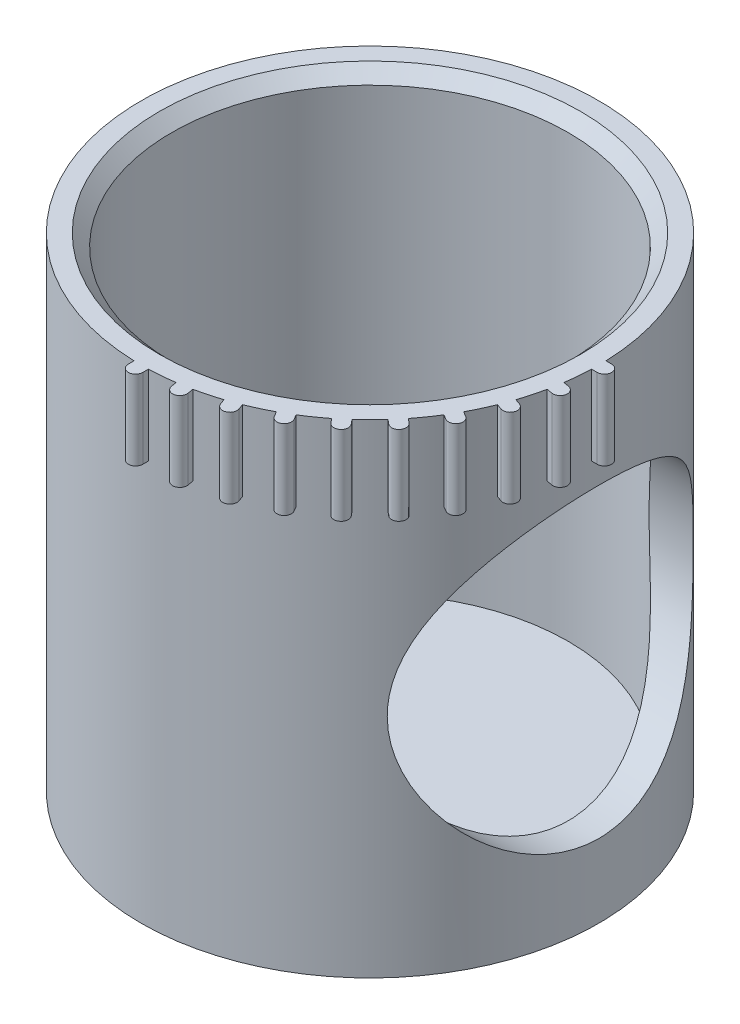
ISO-10303-21;
HEADER;
FILE_DESCRIPTION(('STEP AP214'),'2;1');
FILE_NAME('part.step','',(''),(''),'','','');
FILE_SCHEMA(('AUTOMOTIVE_DESIGN { 1 0 10303 214 1 1 1 1 }'));
ENDSEC;
DATA;
#1=APPLICATION_CONTEXT('core data for automotive mechanical design processes');
#2=APPLICATION_PROTOCOL_DEFINITION('international standard','automotive_design',2000,#1);
#3=PRODUCT_CONTEXT('',#1,'mechanical');
#4=PRODUCT('Part','Part','',(#3));
#5=PRODUCT_RELATED_PRODUCT_CATEGORY('part','',(#4));
#6=PRODUCT_DEFINITION_FORMATION('','',#4);
#7=PRODUCT_DEFINITION_CONTEXT('part definition',#1,'design');
#8=PRODUCT_DEFINITION('design','',#6,#7);
#9=PRODUCT_DEFINITION_SHAPE('','',#8);
#10=(LENGTH_UNIT() NAMED_UNIT(*) SI_UNIT(.MILLI.,.METRE.));
#11=(NAMED_UNIT(*) PLANE_ANGLE_UNIT() SI_UNIT($,.RADIAN.));
#12=(NAMED_UNIT(*) SI_UNIT($,.STERADIAN.) SOLID_ANGLE_UNIT());
#13=UNCERTAINTY_MEASURE_WITH_UNIT(LENGTH_MEASURE(1.E-05),#10,'distance_accuracy_value','');
#14=(GEOMETRIC_REPRESENTATION_CONTEXT(3) GLOBAL_UNCERTAINTY_ASSIGNED_CONTEXT((#13)) GLOBAL_UNIT_ASSIGNED_CONTEXT((#10,
#11,#12)) REPRESENTATION_CONTEXT('',''));
#15=CARTESIAN_POINT('',(0.,0.,0.));
#16=DIRECTION('',(0.,0.,1.));
#17=DIRECTION('',(1.,0.,0.));
#18=AXIS2_PLACEMENT_3D('',#15,#16,#17);
#19=CARTESIAN_POINT('',(0.,37.,0.));
#20=DIRECTION('',(0.,-1.,0.));
#21=DIRECTION('',(0.,0.,-1.));
#22=AXIS2_PLACEMENT_3D('',#19,#20,#21);
#23=CYLINDRICAL_SURFACE('',#22,18.7);
#24=CARTESIAN_POINT('',(0.,37.,0.));
#25=DIRECTION('',(0.,1.,0.));
#26=DIRECTION('',(0.,0.,1.));
#27=AXIS2_PLACEMENT_3D('',#24,#25,#26);
#28=CIRCLE('',#27,18.7);
#29=CARTESIAN_POINT('',(18.6906991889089,37.,-0.589715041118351));
#30=VERTEX_POINT('',#29);
#31=CARTESIAN_POINT('',(-0.589715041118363,37.,18.6906991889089));
#32=VERTEX_POINT('',#31);
#33=EDGE_CURVE('E314',#30,#32,#28,.T.);
#34=ORIENTED_EDGE('',*,*,#33,.F.);
#35=DIRECTION('',(0.,1.,0.));
#36=VECTOR('',#35,1.);
#37=CARTESIAN_POINT('',(18.6906991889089,30.5,-0.589715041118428));
#38=LINE('',#37,#36);
#39=CARTESIAN_POINT('',(18.6906991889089,30.5,-0.589715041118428));
#40=VERTEX_POINT('',#39);
#41=EDGE_CURVE('E307',#40,#30,#38,.T.);
#42=ORIENTED_EDGE('',*,*,#41,.F.);
#43=CARTESIAN_POINT('',(0.,30.5,0.));
#44=DIRECTION('',(0.,1.,0.));
#45=DIRECTION('',(0.,0.,1.));
#46=AXIS2_PLACEMENT_3D('',#43,#44,#45);
#47=CIRCLE('',#46,18.7);
#48=CARTESIAN_POINT('',(18.6906991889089,30.5,0.589715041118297));
#49=VERTEX_POINT('',#48);
#50=EDGE_CURVE('E292',#49,#40,#47,.T.);
#51=ORIENTED_EDGE('',*,*,#50,.F.);
#52=DIRECTION('',(0.,1.,0.));
#53=VECTOR('',#52,1.);
#54=CARTESIAN_POINT('',(18.6906991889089,30.5,0.589715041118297));
#55=LINE('',#54,#53);
#56=CARTESIAN_POINT('',(18.6906991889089,37.,0.589715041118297));
#57=VERTEX_POINT('',#56);
#58=EDGE_CURVE('E315',#49,#57,#55,.T.);
#59=ORIENTED_EDGE('',*,*,#58,.T.);
#60=CARTESIAN_POINT('',(18.5091484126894,37.,2.66484990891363));
#61=VERTEX_POINT('',#60);
#62=EDGE_CURVE('E984',#61,#57,#28,.T.);
#63=ORIENTED_EDGE('',*,*,#62,.F.);
#64=DIRECTION('',(0.,1.,0.));
#65=VECTOR('',#64,1.);
#66=CARTESIAN_POINT('',(18.5091484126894,30.5,2.66484990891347));
#67=LINE('',#66,#65);
#68=CARTESIAN_POINT('',(18.5091484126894,30.5,2.66484990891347));
#69=VERTEX_POINT('',#68);
#70=EDGE_CURVE('E333',#69,#61,#67,.T.);
#71=ORIENTED_EDGE('',*,*,#70,.F.);
#72=CARTESIAN_POINT('',(0.,30.5,0.));
#73=DIRECTION('',(0.,1.,0.));
#74=DIRECTION('',(0.,0.,1.));
#75=AXIS2_PLACEMENT_3D('',#72,#73,#74);
#76=CIRCLE('',#75,18.7);
#77=CARTESIAN_POINT('',(18.3043425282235,30.5,3.82636179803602));
#78=VERTEX_POINT('',#77);
#79=EDGE_CURVE('E303',#78,#69,#76,.T.);
#80=ORIENTED_EDGE('',*,*,#79,.F.);
#81=DIRECTION('',(0.,1.,0.));
#82=VECTOR('',#81,1.);
#83=CARTESIAN_POINT('',(18.3043425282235,30.5,3.82636179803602));
#84=LINE('',#83,#82);
#85=CARTESIAN_POINT('',(18.3043425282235,37.,3.82636179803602));
#86=VERTEX_POINT('',#85);
#87=EDGE_CURVE('E344',#78,#86,#84,.T.);
#88=ORIENTED_EDGE('',*,*,#87,.T.);
#89=CARTESIAN_POINT('',(17.7652065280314,37.,5.83844474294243));
#90=VERTEX_POINT('',#89);
#91=EDGE_CURVE('E986',#90,#86,#28,.T.);
#92=ORIENTED_EDGE('',*,*,#91,.F.);
#93=DIRECTION('',(0.,1.,0.));
#94=VECTOR('',#93,1.);
#95=CARTESIAN_POINT('',(17.7652065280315,30.5,5.83844474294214));
#96=LINE('',#95,#94);
#97=CARTESIAN_POINT('',(17.7652065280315,30.5,5.83844474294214));
#98=VERTEX_POINT('',#97);
#99=EDGE_CURVE('E358',#98,#90,#96,.T.);
#100=ORIENTED_EDGE('',*,*,#99,.F.);
#101=CARTESIAN_POINT('',(0.,30.5,0.));
#102=DIRECTION('',(0.,1.,0.));
#103=DIRECTION('',(0.,0.,1.));
#104=AXIS2_PLACEMENT_3D('',#101,#102,#103);
#105=CIRCLE('',#104,18.7);
#106=CARTESIAN_POINT('',(17.3618176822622,30.5,6.94674648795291));
#107=VERTEX_POINT('',#106);
#108=EDGE_CURVE('E1028',#107,#98,#105,.T.);
#109=ORIENTED_EDGE('',*,*,#108,.F.);
#110=DIRECTION('',(0.,1.,0.));
#111=VECTOR('',#110,1.);
#112=CARTESIAN_POINT('',(17.3618176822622,30.5,6.94674648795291));
#113=LINE('',#112,#111);
#114=CARTESIAN_POINT('',(17.3618176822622,37.,6.94674648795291));
#115=VERTEX_POINT('',#114);
#116=EDGE_CURVE('E370',#107,#115,#113,.T.);
#117=ORIENTED_EDGE('',*,*,#116,.T.);
#118=CARTESIAN_POINT('',(16.4814778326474,37.,8.83464138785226));
#119=VERTEX_POINT('',#118);
#120=EDGE_CURVE('E1004',#119,#115,#28,.T.);
#121=ORIENTED_EDGE('',*,*,#120,.F.);
#122=DIRECTION('',(0.,1.,0.));
#123=VECTOR('',#122,1.);
#124=CARTESIAN_POINT('',(16.4814778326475,30.5,8.83464138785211));
#125=LINE('',#124,#123);
#126=CARTESIAN_POINT('',(16.4814778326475,30.5,8.83464138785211));
#127=VERTEX_POINT('',#126);
#128=EDGE_CURVE('E385',#127,#119,#125,.T.);
#129=ORIENTED_EDGE('',*,*,#128,.F.);
#130=CARTESIAN_POINT('',(0.,30.5,0.));
#131=DIRECTION('',(0.,1.,0.));
#132=DIRECTION('',(0.,0.,1.));
#133=AXIS2_PLACEMENT_3D('',#130,#131,#132);
#134=CIRCLE('',#133,18.7);
#135=CARTESIAN_POINT('',(15.8917627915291,30.5,9.85605780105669));
#136=VERTEX_POINT('',#135);
#137=EDGE_CURVE('E1030',#136,#127,#134,.T.);
#138=ORIENTED_EDGE('',*,*,#137,.F.);
#139=DIRECTION('',(0.,1.,0.));
#140=VECTOR('',#139,1.);
#141=CARTESIAN_POINT('',(15.8917627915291,30.5,9.85605780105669));
#142=LINE('',#141,#140);
#143=CARTESIAN_POINT('',(15.8917627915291,37.,9.85605780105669));
#144=VERTEX_POINT('',#143);
#145=EDGE_CURVE('E397',#136,#144,#142,.T.);
#146=ORIENTED_EDGE('',*,*,#145,.T.);
#147=CARTESIAN_POINT('',(14.6969677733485,37.,11.5624019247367));
#148=VERTEX_POINT('',#147);
#149=EDGE_CURVE('E1001',#148,#144,#28,.T.);
#150=ORIENTED_EDGE('',*,*,#149,.F.);
#151=DIRECTION('',(0.,1.,0.));
#152=VECTOR('',#151,1.);
#153=CARTESIAN_POINT('',(14.6969677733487,30.5,11.5624019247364));
#154=LINE('',#153,#152);
#155=CARTESIAN_POINT('',(14.6969677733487,30.5,11.5624019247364));
#156=VERTEX_POINT('',#155);
#157=EDGE_CURVE('E412',#156,#148,#154,.T.);
#158=ORIENTED_EDGE('',*,*,#157,.F.);
#159=CARTESIAN_POINT('',(0.,30.5,0.));
#160=DIRECTION('',(0.,1.,0.));
#161=DIRECTION('',(0.,0.,1.));
#162=AXIS2_PLACEMENT_3D('',#159,#160,#161);
#163=CIRCLE('',#162,18.7);
#164=CARTESIAN_POINT('',(13.9388447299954,30.5,12.4658977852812));
#165=VERTEX_POINT('',#164);
#166=EDGE_CURVE('E1042',#165,#156,#163,.T.);
#167=ORIENTED_EDGE('',*,*,#166,.F.);
#168=DIRECTION('',(0.,1.,0.));
#169=VECTOR('',#168,1.);
#170=CARTESIAN_POINT('',(13.9388447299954,30.5,12.4658977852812));
#171=LINE('',#170,#169);
#172=CARTESIAN_POINT('',(13.9388447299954,37.,12.4658977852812));
#173=VERTEX_POINT('',#172);
#174=EDGE_CURVE('E424',#165,#173,#171,.T.);
#175=ORIENTED_EDGE('',*,*,#174,.T.);
#176=CARTESIAN_POINT('',(12.4658977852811,37.,13.9388447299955));
#177=VERTEX_POINT('',#176);
#178=EDGE_CURVE('E998',#177,#173,#28,.T.);
#179=ORIENTED_EDGE('',*,*,#178,.F.);
#180=DIRECTION('',(0.,1.,0.));
#181=VECTOR('',#180,1.);
#182=CARTESIAN_POINT('',(12.4658977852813,30.5,13.9388447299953));
#183=LINE('',#182,#181);
#184=CARTESIAN_POINT('',(12.4658977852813,30.5,13.9388447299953));
#185=VERTEX_POINT('',#184);
#186=EDGE_CURVE('E439',#185,#177,#183,.T.);
#187=ORIENTED_EDGE('',*,*,#186,.F.);
#188=CARTESIAN_POINT('',(0.,30.5,0.));
#189=DIRECTION('',(0.,1.,0.));
#190=DIRECTION('',(0.,0.,1.));
#191=AXIS2_PLACEMENT_3D('',#188,#189,#190);
#192=CIRCLE('',#191,18.7);
#193=CARTESIAN_POINT('',(11.5624019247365,30.5,14.6969677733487));
#194=VERTEX_POINT('',#193);
#195=EDGE_CURVE('E1044',#194,#185,#192,.T.);
#196=ORIENTED_EDGE('',*,*,#195,.F.);
#197=DIRECTION('',(0.,1.,0.));
#198=VECTOR('',#197,1.);
#199=CARTESIAN_POINT('',(11.5624019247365,30.5,14.6969677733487));
#200=LINE('',#199,#198);
#201=CARTESIAN_POINT('',(11.5624019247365,37.,14.6969677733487));
#202=VERTEX_POINT('',#201);
#203=EDGE_CURVE('E451',#194,#202,#200,.T.);
#204=ORIENTED_EDGE('',*,*,#203,.T.);
#205=CARTESIAN_POINT('',(9.8560578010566,37.,15.8917627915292));
#206=VERTEX_POINT('',#205);
#207=EDGE_CURVE('E995',#206,#202,#28,.T.);
#208=ORIENTED_EDGE('',*,*,#207,.F.);
#209=DIRECTION('',(0.,1.,0.));
#210=VECTOR('',#209,1.);
#211=CARTESIAN_POINT('',(9.85605780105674,30.5,15.8917627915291));
#212=LINE('',#211,#210);
#213=CARTESIAN_POINT('',(9.85605780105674,30.5,15.8917627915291));
#214=VERTEX_POINT('',#213);
#215=EDGE_CURVE('E466',#214,#206,#212,.T.);
#216=ORIENTED_EDGE('',*,*,#215,.F.);
#217=CARTESIAN_POINT('',(0.,30.5,0.));
#218=DIRECTION('',(0.,1.,0.));
#219=DIRECTION('',(0.,0.,1.));
#220=AXIS2_PLACEMENT_3D('',#217,#218,#219);
#221=CIRCLE('',#220,18.7);
#222=CARTESIAN_POINT('',(8.83464138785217,30.5,16.4814778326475));
#223=VERTEX_POINT('',#222);
#224=EDGE_CURVE('E1046',#223,#214,#221,.T.);
#225=ORIENTED_EDGE('',*,*,#224,.F.);
#226=DIRECTION('',(0.,1.,0.));
#227=VECTOR('',#226,1.);
#228=CARTESIAN_POINT('',(8.83464138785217,30.5,16.4814778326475));
#229=LINE('',#228,#227);
#230=CARTESIAN_POINT('',(8.83464138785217,37.,16.4814778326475));
#231=VERTEX_POINT('',#230);
#232=EDGE_CURVE('E478',#223,#231,#229,.T.);
#233=ORIENTED_EDGE('',*,*,#232,.T.);
#234=CARTESIAN_POINT('',(6.9467464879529,37.,17.3618176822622));
#235=VERTEX_POINT('',#234);
#236=EDGE_CURVE('E992',#235,#231,#28,.T.);
#237=ORIENTED_EDGE('',*,*,#236,.F.);
#238=DIRECTION('',(0.,1.,0.));
#239=VECTOR('',#238,1.);
#240=CARTESIAN_POINT('',(6.94674648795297,30.5,17.3618176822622));
#241=LINE('',#240,#239);
#242=CARTESIAN_POINT('',(6.94674648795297,30.5,17.3618176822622));
#243=VERTEX_POINT('',#242);
#244=EDGE_CURVE('E493',#243,#235,#241,.T.);
#245=ORIENTED_EDGE('',*,*,#244,.F.);
#246=CARTESIAN_POINT('',(0.,30.5,0.));
#247=DIRECTION('',(0.,1.,0.));
#248=DIRECTION('',(0.,0.,1.));
#249=AXIS2_PLACEMENT_3D('',#246,#247,#248);
#250=CIRCLE('',#249,18.7);
#251=CARTESIAN_POINT('',(5.8384447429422,30.5,17.7652065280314));
#252=VERTEX_POINT('',#251);
#253=EDGE_CURVE('E1048',#252,#243,#250,.T.);
#254=ORIENTED_EDGE('',*,*,#253,.F.);
#255=DIRECTION('',(0.,1.,0.));
#256=VECTOR('',#255,1.);
#257=CARTESIAN_POINT('',(5.8384447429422,30.5,17.7652065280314));
#258=LINE('',#257,#256);
#259=CARTESIAN_POINT('',(5.8384447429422,37.,17.7652065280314));
#260=VERTEX_POINT('',#259);
#261=EDGE_CURVE('E505',#252,#260,#258,.T.);
#262=ORIENTED_EDGE('',*,*,#261,.T.);
#263=CARTESIAN_POINT('',(3.82636179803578,37.,18.3043425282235));
#264=VERTEX_POINT('',#263);
#265=EDGE_CURVE('E988',#264,#260,#28,.T.);
#266=ORIENTED_EDGE('',*,*,#265,.F.);
#267=DIRECTION('',(0.,1.,0.));
#268=VECTOR('',#267,1.);
#269=CARTESIAN_POINT('',(3.82636179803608,30.5,18.3043425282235));
#270=LINE('',#269,#268);
#271=CARTESIAN_POINT('',(3.82636179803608,30.5,18.3043425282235));
#272=VERTEX_POINT('',#271);
#273=EDGE_CURVE('E520',#272,#264,#270,.T.);
#274=ORIENTED_EDGE('',*,*,#273,.F.);
#275=CARTESIAN_POINT('',(0.,30.5,0.));
#276=DIRECTION('',(0.,1.,0.));
#277=DIRECTION('',(0.,0.,1.));
#278=AXIS2_PLACEMENT_3D('',#275,#276,#277);
#279=CIRCLE('',#278,18.7);
#280=CARTESIAN_POINT('',(2.66484990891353,30.5,18.5091484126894));
#281=VERTEX_POINT('',#280);
#282=EDGE_CURVE('E990',#281,#272,#279,.T.);
#283=ORIENTED_EDGE('',*,*,#282,.F.);
#284=DIRECTION('',(0.,1.,0.));
#285=VECTOR('',#284,1.);
#286=CARTESIAN_POINT('',(2.66484990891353,30.5,18.5091484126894));
#287=LINE('',#286,#285);
#288=CARTESIAN_POINT('',(2.66484990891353,37.,18.5091484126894));
#289=VERTEX_POINT('',#288);
#290=EDGE_CURVE('E532',#281,#289,#287,.T.);
#291=ORIENTED_EDGE('',*,*,#290,.T.);
#292=CARTESIAN_POINT('',(0.589715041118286,37.,18.6906991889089));
#293=VERTEX_POINT('',#292);
#294=EDGE_CURVE('E591',#293,#289,#28,.T.);
#295=ORIENTED_EDGE('',*,*,#294,.F.);
#296=DIRECTION('',(0.,1.,0.));
#297=VECTOR('',#296,1.);
#298=CARTESIAN_POINT('',(0.589715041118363,30.5,18.6906991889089));
#299=LINE('',#298,#297);
#300=CARTESIAN_POINT('',(0.589715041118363,30.5,18.6906991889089));
#301=VERTEX_POINT('',#300);
#302=EDGE_CURVE('E547',#301,#293,#299,.T.);
#303=ORIENTED_EDGE('',*,*,#302,.F.);
#304=CARTESIAN_POINT('',(0.,30.5,0.));
#305=DIRECTION('',(0.,1.,0.));
#306=DIRECTION('',(0.,0.,1.));
#307=AXIS2_PLACEMENT_3D('',#304,#305,#306);
#308=CIRCLE('',#307,18.7);
#309=CARTESIAN_POINT('',(-0.589715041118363,30.5,18.6906991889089));
#310=VERTEX_POINT('',#309);
#311=EDGE_CURVE('E592',#310,#301,#308,.T.);
#312=ORIENTED_EDGE('',*,*,#311,.F.);
#313=DIRECTION('',(0.,1.,0.));
#314=VECTOR('',#313,1.);
#315=CARTESIAN_POINT('',(-0.589715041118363,30.5,18.6906991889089));
#316=LINE('',#315,#314);
#317=EDGE_CURVE('E559',#310,#32,#316,.T.);
#318=ORIENTED_EDGE('',*,*,#317,.T.);
#319=EDGE_LOOP('',(#34,#42,#51,#59,#63,#71,#80,#88,#92,#100,#109,#117,#121,#129,#138,#146,#150,
#158,#167,#175,#179,#187,#196,#204,#208,#216,#225,#233,#237,#245,#254,#262,#266,#274,#283,#291,
#295,#303,#312,#318));
#320=FACE_BOUND('',#319,.T.);
#321=CARTESIAN_POINT('',(0.,-2.5,0.));
#322=DIRECTION('',(0.,1.,0.));
#323=DIRECTION('',(0.,0.,1.));
#324=AXIS2_PLACEMENT_3D('',#321,#322,#323);
#325=CIRCLE('',#324,18.7);
#326=CARTESIAN_POINT('',(0.,-2.5,18.7));
#327=VERTEX_POINT('',#326);
#328=EDGE_CURVE('E981',#327,#327,#325,.T.);
#329=ORIENTED_EDGE('',*,*,#328,.T.);
#330=EDGE_LOOP('',(#329));
#331=FACE_BOUND('',#330,.T.);
#332=CARTESIAN_POINT('',(18.7,3.5,0.));
#333=CARTESIAN_POINT('',(18.7000001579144,3.49999982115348,-0.313856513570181));
#334=CARTESIAN_POINT('',(18.6920818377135,3.51183629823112,-0.627711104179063));
#335=CARTESIAN_POINT('',(18.660608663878,3.55899428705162,-1.25285059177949));
#336=CARTESIAN_POINT('',(18.6370539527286,3.59431558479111,-1.56413551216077));
#337=CARTESIAN_POINT('',(18.5748784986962,3.68791921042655,-2.18180673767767));
#338=CARTESIAN_POINT('',(18.5362523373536,3.74620979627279,-2.48819123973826));
#339=CARTESIAN_POINT('',(18.444851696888,3.8849154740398,-3.09373892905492));
#340=CARTESIAN_POINT('',(18.392076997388,3.96533091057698,-3.39290200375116));
#341=CARTESIAN_POINT('',(18.2738513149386,4.14679980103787,-3.9806794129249));
#342=CARTESIAN_POINT('',(18.2084620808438,4.24775284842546,-4.26933730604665));
#343=CARTESIAN_POINT('',(18.0662153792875,4.46937308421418,-4.83603337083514));
#344=CARTESIAN_POINT('',(17.9893579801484,4.59004015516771,-5.11407160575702));
#345=CARTESIAN_POINT('',(17.8256866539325,4.84987513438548,-5.65823445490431));
#346=CARTESIAN_POINT('',(17.738874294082,4.98904013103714,-5.92436093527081));
#347=CARTESIAN_POINT('',(17.5568343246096,5.28477642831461,-6.44386258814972));
#348=CARTESIAN_POINT('',(17.4616035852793,5.44135420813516,-6.69723296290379));
#349=CARTESIAN_POINT('',(17.2560174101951,5.78478397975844,-7.21130035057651));
#350=CARTESIAN_POINT('',(17.1450642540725,5.97307743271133,-7.47079508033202));
#351=CARTESIAN_POINT('',(16.917354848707,6.36761446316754,-7.97302584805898));
#352=CARTESIAN_POINT('',(16.8005984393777,6.5738585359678,-8.21576142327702));
#353=CARTESIAN_POINT('',(16.5633132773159,7.00358449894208,-8.68422068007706));
#354=CARTESIAN_POINT('',(16.4427792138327,7.22709136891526,-8.90991873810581));
#355=CARTESIAN_POINT('',(16.200441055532,7.69017379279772,-9.34330482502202));
#356=CARTESIAN_POINT('',(16.0786372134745,7.92974619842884,-9.55099636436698));
#357=CARTESIAN_POINT('',(15.816879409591,8.46367929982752,-9.97942547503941));
#358=CARTESIAN_POINT('',(15.6771190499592,8.76069454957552,-10.1969863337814));
#359=CARTESIAN_POINT('',(15.4032327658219,9.37466448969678,-10.6061800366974));
#360=CARTESIAN_POINT('',(15.2691081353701,9.69162371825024,-10.7978069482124));
#361=CARTESIAN_POINT('',(15.0113313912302,10.3440535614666,-11.1533885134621));
#362=CARTESIAN_POINT('',(14.8876625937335,10.6794932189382,-11.3173876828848));
#363=CARTESIAN_POINT('',(14.6556233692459,11.3683338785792,-11.6163048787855));
#364=CARTESIAN_POINT('',(14.5472534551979,11.7217354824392,-11.7512219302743));
#365=CARTESIAN_POINT('',(14.3797488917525,12.3396481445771,-11.9551175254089));
#366=CARTESIAN_POINT('',(14.315450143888,12.6002145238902,-12.0318715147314));
#367=CARTESIAN_POINT('',(14.1993151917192,13.128275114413,-12.1687102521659));
#368=CARTESIAN_POINT('',(14.1474709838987,13.3957647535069,-12.228805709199));
#369=CARTESIAN_POINT('',(14.0580514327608,13.9360991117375,-12.3314977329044));
#370=CARTESIAN_POINT('',(14.0204582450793,14.2089366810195,-12.3741161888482));
#371=CARTESIAN_POINT('',(13.9608959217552,14.7585427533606,-12.4412786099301));
#372=CARTESIAN_POINT('',(13.9389268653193,15.0353112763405,-12.4658224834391));
#373=CARTESIAN_POINT('',(13.9114704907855,15.5918689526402,-12.4964564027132));
#374=CARTESIAN_POINT('',(13.9060530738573,15.8716659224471,-12.5024681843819));
#375=CARTESIAN_POINT('',(13.9121336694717,16.4308462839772,-12.4957014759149));
#376=CARTESIAN_POINT('',(13.9236317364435,16.7102296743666,-12.482922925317));
#377=CARTESIAN_POINT('',(13.9630614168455,17.2665492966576,-12.4388014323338));
#378=CARTESIAN_POINT('',(13.9910052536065,17.5434835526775,-12.4074446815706));
#379=CARTESIAN_POINT('',(14.0621907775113,18.0926967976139,-12.3267056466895));
#380=CARTESIAN_POINT('',(14.1054327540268,18.3649756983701,-12.277323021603));
#381=CARTESIAN_POINT('',(14.2033060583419,18.8909575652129,-12.1639396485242));
#382=CARTESIAN_POINT('',(14.2573286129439,19.1449416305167,-12.1007075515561));
#383=CARTESIAN_POINT('',(14.3762039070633,19.6461690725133,-11.9592345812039));
#384=CARTESIAN_POINT('',(14.4410601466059,19.8934102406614,-11.8809888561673));
#385=CARTESIAN_POINT('',(14.5798611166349,20.3802752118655,-11.7102410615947));
#386=CARTESIAN_POINT('',(14.6538058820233,20.6198989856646,-11.6177389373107));
#387=CARTESIAN_POINT('',(14.8090704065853,21.090975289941,-11.4191645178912));
#388=CARTESIAN_POINT('',(14.8903904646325,21.3224274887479,-11.3130916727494));
#389=CARTESIAN_POINT('',(15.0759614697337,21.8231595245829,-11.0649906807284));
#390=CARTESIAN_POINT('',(15.1815047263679,22.0905164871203,-10.9200429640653));
#391=CARTESIAN_POINT('',(15.3982300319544,22.6122461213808,-10.6122542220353));
#392=CARTESIAN_POINT('',(15.5094115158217,22.866620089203,-10.4494149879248));
#393=CARTESIAN_POINT('',(15.7351332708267,23.3622793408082,-10.1063243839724));
#394=CARTESIAN_POINT('',(15.8496774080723,23.6035485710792,-9.9260523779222));
#395=CARTESIAN_POINT('',(16.0797556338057,24.0721872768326,-9.54883672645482));
#396=CARTESIAN_POINT('',(16.1952897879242,24.2995558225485,-9.3518919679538));
#397=CARTESIAN_POINT('',(16.4503541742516,24.7878593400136,-8.89706822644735));
#398=CARTESIAN_POINT('',(16.5896215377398,25.0452979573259,-8.63526837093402));
#399=CARTESIAN_POINT('',(16.8629821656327,25.5374008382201,-8.08846642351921));
#400=CARTESIAN_POINT('',(16.9970744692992,25.772060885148,-7.80346005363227));
#401=CARTESIAN_POINT('',(17.2565709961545,26.2167416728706,-7.21145827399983));
#402=CARTESIAN_POINT('',(17.381981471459,26.4267802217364,-6.90447901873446));
#403=CARTESIAN_POINT('',(17.6209048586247,26.8203855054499,-6.26966036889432));
#404=CARTESIAN_POINT('',(17.7344210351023,27.0039595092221,-5.94182673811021));
#405=CARTESIAN_POINT('',(17.9256562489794,27.3093053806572,-5.33308575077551));
#406=CARTESIAN_POINT('',(18.0060339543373,27.4361420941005,-5.0555441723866));
#407=CARTESIAN_POINT('',(18.1554852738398,27.6700361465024,-4.48932497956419));
#408=CARTESIAN_POINT('',(18.2245610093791,27.7770971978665,-4.20064946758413));
#409=CARTESIAN_POINT('',(18.3499347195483,27.970191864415,-3.61384106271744));
#410=CARTESIAN_POINT('',(18.4062408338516,28.0562388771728,-3.31571433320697));
#411=CARTESIAN_POINT('',(18.5048766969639,28.206295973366,-2.71167337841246));
#412=CARTESIAN_POINT('',(18.5472062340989,28.2703057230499,-2.40575903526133));
#413=CARTESIAN_POINT('',(18.6170407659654,28.375611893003,-1.7869425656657));
#414=CARTESIAN_POINT('',(18.6444790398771,28.4168061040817,-1.47401542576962));
#415=CARTESIAN_POINT('',(18.6835585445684,28.4754093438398,-0.844952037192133));
#416=CARTESIAN_POINT('',(18.6951997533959,28.4928183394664,-0.528815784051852));
#417=CARTESIAN_POINT('',(18.7023878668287,28.503572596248,0.104033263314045));
#418=CARTESIAN_POINT('',(18.6979355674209,28.4969190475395,0.42074602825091));
#419=CARTESIAN_POINT('',(18.6730516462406,28.4596569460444,1.05211332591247));
#420=CARTESIAN_POINT('',(18.6526207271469,28.4290494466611,1.36676794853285));
#421=CARTESIAN_POINT('',(18.5983185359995,28.3474007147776,1.96910112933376));
#422=CARTESIAN_POINT('',(18.565514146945,28.297979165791,2.25709828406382));
#423=CARTESIAN_POINT('',(18.487276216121,28.179546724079,2.82726266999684));
#424=CARTESIAN_POINT('',(18.4418433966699,28.1105369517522,3.10943023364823));
#425=CARTESIAN_POINT('',(18.339255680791,27.9537363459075,3.66631700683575));
#426=CARTESIAN_POINT('',(18.2821000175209,27.865944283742,3.94103572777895));
#427=CARTESIAN_POINT('',(18.1571493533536,27.6725113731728,4.48161856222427));
#428=CARTESIAN_POINT('',(18.0893537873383,27.5668695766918,4.74748220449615));
#429=CARTESIAN_POINT('',(17.9400268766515,27.3319578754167,5.28466544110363));
#430=CARTESIAN_POINT('',(17.8579195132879,27.2016585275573,5.55537417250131));
#431=CARTESIAN_POINT('',(17.6846219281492,26.9232652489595,6.08454626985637));
#432=CARTESIAN_POINT('',(17.5934286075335,26.7751652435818,6.34300541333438));
#433=CARTESIAN_POINT('',(17.4035485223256,26.4622641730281,6.84682369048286));
#434=CARTESIAN_POINT('',(17.3048594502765,26.2974579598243,7.09217875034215));
#435=CARTESIAN_POINT('',(17.1016541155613,25.9521883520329,7.56905667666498));
#436=CARTESIAN_POINT('',(16.9971375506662,25.7717241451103,7.80057882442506));
#437=CARTESIAN_POINT('',(16.7670490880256,25.3662200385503,8.28485700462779));
#438=CARTESIAN_POINT('',(16.6407661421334,25.1386491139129,8.53515995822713));
#439=CARTESIAN_POINT('',(16.3853664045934,24.6648738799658,9.01575366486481));
#440=CARTESIAN_POINT('',(16.2562501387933,24.4186730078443,9.24604809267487));
#441=CARTESIAN_POINT('',(15.9978884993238,23.9082819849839,9.68621380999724));
#442=CARTESIAN_POINT('',(15.8686431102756,23.6440765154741,9.89606732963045));
#443=CARTESIAN_POINT('',(15.613206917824,23.0986125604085,10.2943541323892));
#444=CARTESIAN_POINT('',(15.4870158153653,22.817355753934,10.4827895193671));
#445=CARTESIAN_POINT('',(15.2509212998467,22.26168182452,10.8230669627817));
#446=CARTESIAN_POINT('',(15.1405238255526,21.9885304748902,10.9766326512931));
#447=CARTESIAN_POINT('',(14.9280079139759,21.4288510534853,11.263947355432));
#448=CARTESIAN_POINT('',(14.8258896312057,21.1423227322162,11.3976960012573));
#449=CARTESIAN_POINT('',(14.6332031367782,20.5570662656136,11.644045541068));
#450=CARTESIAN_POINT('',(14.5426181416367,20.2583567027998,11.7566772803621));
#451=CARTESIAN_POINT('',(14.3761312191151,19.6494915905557,11.9596870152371));
#452=CARTESIAN_POINT('',(14.3002258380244,19.3393387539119,12.0500702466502));
#453=CARTESIAN_POINT('',(14.1786095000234,18.7669881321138,12.1927904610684));
#454=CARTESIAN_POINT('',(14.1299149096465,18.5064026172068,12.2490631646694));
#455=CARTESIAN_POINT('',(14.0461106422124,17.9800676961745,12.3450740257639));
#456=CARTESIAN_POINT('',(14.0109981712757,17.7143193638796,12.3848155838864));
#457=CARTESIAN_POINT('',(13.9556651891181,17.1795119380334,12.4471344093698));
#458=CARTESIAN_POINT('',(13.9354311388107,16.9104560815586,12.4697272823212));
#459=CARTESIAN_POINT('',(13.910598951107,16.3707120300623,12.497423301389));
#460=CARTESIAN_POINT('',(13.9060010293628,16.1000238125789,12.5025262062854));
#461=CARTESIAN_POINT('',(13.9126319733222,15.5588864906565,12.4951468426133));
#462=CARTESIAN_POINT('',(13.9238723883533,15.2884377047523,12.4826517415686));
#463=CARTESIAN_POINT('',(13.9617454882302,14.7500107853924,12.4402757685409));
#464=CARTESIAN_POINT('',(13.9883780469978,14.4820326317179,12.4103950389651));
#465=CARTESIAN_POINT('',(14.0560488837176,13.9500713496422,12.3336975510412));
#466=CARTESIAN_POINT('',(14.0971029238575,13.6860929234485,12.2868622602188));
#467=CARTESIAN_POINT('',(14.1921633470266,13.1638987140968,12.1769357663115));
#468=CARTESIAN_POINT('',(14.2461726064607,12.905684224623,12.1138409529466));
#469=CARTESIAN_POINT('',(14.3811413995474,12.3291590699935,11.9535121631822));
#470=CARTESIAN_POINT('',(14.4654529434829,12.0129110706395,11.8516636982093));
#471=CARTESIAN_POINT('',(14.6483951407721,11.3931288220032,11.6247893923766));
#472=CARTESIAN_POINT('',(14.7470297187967,11.0895980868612,11.4997571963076));
#473=CARTESIAN_POINT('',(14.9551506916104,10.4960118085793,11.2277697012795));
#474=CARTESIAN_POINT('',(15.0646486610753,10.2059711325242,11.0807909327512));
#475=CARTESIAN_POINT('',(15.2910767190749,9.64042597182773,10.7661753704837));
#476=CARTESIAN_POINT('',(15.408006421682,9.36492073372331,10.5985396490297));
#477=CARTESIAN_POINT('',(15.6484701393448,8.82404179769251,10.2402529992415));
#478=CARTESIAN_POINT('',(15.7720860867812,8.55894780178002,10.0492353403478));
#479=CARTESIAN_POINT('',(16.0209826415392,8.04497415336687,9.64748471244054));
#480=CARTESIAN_POINT('',(16.1462633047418,7.79609504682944,9.43675108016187));
#481=CARTESIAN_POINT('',(16.3958348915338,7.31520592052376,8.99615007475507));
#482=CARTESIAN_POINT('',(16.5201255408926,7.08320043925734,8.76627758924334));
#483=CARTESIAN_POINT('',(16.765162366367,6.63701862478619,8.28803591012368));
#484=CARTESIAN_POINT('',(16.8859082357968,6.42284383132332,8.03966512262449));
#485=CARTESIAN_POINT('',(17.1389386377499,5.98300326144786,7.4868139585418));
#486=CARTESIAN_POINT('',(17.2702721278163,5.76035800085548,7.17947976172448));
#487=CARTESIAN_POINT('',(17.5215180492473,5.34206645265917,6.54244926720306));
#488=CARTESIAN_POINT('',(17.6414288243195,5.1464240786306,6.21274973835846));
#489=CARTESIAN_POINT('',(17.8662394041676,4.78471770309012,5.5331217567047));
#490=CARTESIAN_POINT('',(17.9711564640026,4.618619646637,5.18321721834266));
#491=CARTESIAN_POINT('',(18.1628545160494,4.31827671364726,4.46526714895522));
#492=CARTESIAN_POINT('',(18.2496415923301,4.18402114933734,4.0972277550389));
#493=CARTESIAN_POINT('',(18.3862570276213,3.97422079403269,3.42455860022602));
#494=CARTESIAN_POINT('',(18.4400184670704,3.89227113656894,3.12270947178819));
#495=CARTESIAN_POINT('',(18.5331404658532,3.75091294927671,2.51160668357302));
#496=CARTESIAN_POINT('',(18.5725032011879,3.69150101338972,2.20235415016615));
#497=CARTESIAN_POINT('',(18.6358569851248,3.59611205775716,1.5789065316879));
#498=CARTESIAN_POINT('',(18.6598583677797,3.56011928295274,1.26471491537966));
#499=CARTESIAN_POINT('',(18.6919299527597,3.51206310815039,0.633681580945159));
#500=CARTESIAN_POINT('',(18.6999998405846,3.50000018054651,0.316839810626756));
#501=CARTESIAN_POINT('',(18.7,3.5,0.));
#502=B_SPLINE_CURVE_WITH_KNOTS('',3,(#332,#333,#334,#335,#336,#337,#338,#339,#340,#341,#342,
#343,#344,#345,#346,#347,#348,#349,#350,#351,#352,#353,#354,#355,#356,#357,#358,#359,#360,#361,
#362,#363,#364,#365,#366,#367,#368,#369,#370,#371,#372,#373,#374,#375,#376,#377,#378,#379,#380,
#381,#382,#383,#384,#385,#386,#387,#388,#389,#390,#391,#392,#393,#394,#395,#396,#397,#398,#399,
#400,#401,#402,#403,#404,#405,#406,#407,#408,#409,#410,#411,#412,#413,#414,#415,#416,#417,#418,
#419,#420,#421,#422,#423,#424,#425,#426,#427,#428,#429,#430,#431,#432,#433,#434,#435,#436,#437,
#438,#439,#440,#441,#442,#443,#444,#445,#446,#447,#448,#449,#450,#451,#452,#453,#454,#455,#456,
#457,#458,#459,#460,#461,#462,#463,#464,#465,#466,#467,#468,#469,#470,#471,#472,#473,#474,#475,
#476,#477,#478,#479,#480,#481,#482,#483,#484,#485,#486,#487,#488,#489,#490,#491,#492,#493,#494,
#495,#496,#497,#498,#499,#500,#501),.UNSPECIFIED.,.T.,.F.,(4,2,2,2,2,2,2,2,2,2,2,2,2,2,2,2,2,2,
2,2,2,2,2,2,2,2,2,2,2,2,2,2,2,2,2,2,2,2,2,2,2,2,2,2,2,2,2,2,2,2,2,2,2,2,2,2,2,2,2,2,2,2,2,2,2,2,
2,2,2,2,2,2,2,2,2,2,2,2,2,2,2,2,2,2,4),(0.,0.941246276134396,1.88248397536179,2.82406037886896,
3.76565144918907,4.70274525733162,5.63983348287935,6.57677438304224,7.51406508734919,
8.53087972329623,9.54772242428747,10.5660651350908,11.5842088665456,12.7642447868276,
13.9445501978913,15.1229352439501,16.3013597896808,17.1380223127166,17.9741457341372,
18.8092187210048,19.6442959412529,20.4828950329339,21.3214968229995,22.1607226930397,
22.9999644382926,23.8009639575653,24.6022227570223,25.4034846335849,26.2047789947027,
27.1696449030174,28.1344142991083,29.1003400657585,30.0663303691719,31.2430298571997,
32.4199467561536,33.5960071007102,34.7717438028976,35.7174796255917,36.6630377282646,
37.6079914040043,38.5529593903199,39.5021270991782,40.4512961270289,41.4004182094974,
42.3494985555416,43.2306355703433,44.1117221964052,44.9928664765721,45.8740575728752,
46.8074861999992,47.7412342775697,48.675270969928,49.609356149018,50.6915348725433,
51.7735144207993,52.8564263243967,53.9392317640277,54.935047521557,55.9308818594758,
56.9252500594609,57.9193840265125,58.7315712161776,59.5435912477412,60.3548714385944,
61.1661628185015,61.9780460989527,62.7899227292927,63.6026894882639,64.4156368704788,
65.4424701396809,66.4695853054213,67.4978068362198,68.5259750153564,69.5730618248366,
70.6201838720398,71.6675865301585,72.7150795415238,73.9182034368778,75.1215015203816,
76.3234034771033,77.5249014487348,78.4758598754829,79.4266745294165,80.3768488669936,
81.3270419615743),.UNSPECIFIED.);
#503=CARTESIAN_POINT('',(18.7,3.5,0.));
#504=VERTEX_POINT('',#503);
#505=EDGE_CURVE('E563',#504,#504,#502,.T.);
#506=ORIENTED_EDGE('',*,*,#505,.F.);
#507=EDGE_LOOP('',(#506));
#508=FACE_BOUND('',#507,.T.);
#509=ADVANCED_FACE('F32',(#320,#331,#508),#23,.T.);
#510=CARTESIAN_POINT('',(0.,37.,0.));
#511=DIRECTION('',(0.,-1.,0.));
#512=DIRECTION('',(0.,0.,-1.));
#513=AXIS2_PLACEMENT_3D('',#510,#511,#512);
#514=CYLINDRICAL_SURFACE('',#513,16.2);
#515=CARTESIAN_POINT('',(0.,36.,0.));
#516=DIRECTION('',(0.,1.,0.));
#517=DIRECTION('',(0.,0.,1.));
#518=AXIS2_PLACEMENT_3D('',#515,#516,#517);
#519=CIRCLE('',#518,16.2);
#520=CARTESIAN_POINT('',(0.,36.,16.2));
#521=VERTEX_POINT('',#520);
#522=EDGE_CURVE('E40',#521,#521,#519,.T.);
#523=ORIENTED_EDGE('',*,*,#522,.T.);
#524=EDGE_LOOP('',(#523));
#525=FACE_BOUND('',#524,.T.);
#526=CARTESIAN_POINT('',(0.,0.,0.));
#527=DIRECTION('',(0.,1.,0.));
#528=DIRECTION('',(0.,0.,1.));
#529=AXIS2_PLACEMENT_3D('',#526,#527,#528);
#530=CIRCLE('',#529,16.2);
#531=CARTESIAN_POINT('',(0.,0.,16.2));
#532=VERTEX_POINT('',#531);
#533=EDGE_CURVE('E570',#532,#532,#530,.T.);
#534=ORIENTED_EDGE('',*,*,#533,.F.);
#535=EDGE_LOOP('',(#534));
#536=FACE_BOUND('',#535,.T.);
#537=CARTESIAN_POINT('',(10.3048532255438,16.,12.5));
#538=CARTESIAN_POINT('',(10.3048572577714,15.7120750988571,12.4999981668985));
#539=CARTESIAN_POINT('',(10.3169923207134,15.424128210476,12.4900226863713));
#540=CARTESIAN_POINT('',(10.3647209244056,14.8515566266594,12.4504411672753));
#541=CARTESIAN_POINT('',(10.4003182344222,14.5669324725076,12.4208319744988));
#542=CARTESIAN_POINT('',(10.4928807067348,14.0029416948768,12.3427347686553));
#543=CARTESIAN_POINT('',(10.5499138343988,13.7235947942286,12.2941866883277));
#544=CARTESIAN_POINT('',(10.682267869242,13.1729220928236,12.1793594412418));
#545=CARTESIAN_POINT('',(10.7575967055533,12.9015998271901,12.1130725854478));
#546=CARTESIAN_POINT('',(10.8906619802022,12.4729226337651,11.9932504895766));
#547=CARTESIAN_POINT('',(10.9437109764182,12.3126048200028,11.9449103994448));
#548=CARTESIAN_POINT('',(11.0545569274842,11.9955949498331,11.8424015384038));
#549=CARTESIAN_POINT('',(11.1123520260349,11.8389015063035,11.7882350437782));
#550=CARTESIAN_POINT('',(11.2918765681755,11.3741787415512,11.6172626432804));
#551=CARTESIAN_POINT('',(11.4197235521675,11.0715750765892,11.4920030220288));
#552=CARTESIAN_POINT('',(11.6867339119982,10.4810148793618,11.2203641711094));
#553=CARTESIAN_POINT('',(11.8259064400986,10.1930705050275,11.0739677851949));
#554=CARTESIAN_POINT('',(12.1112756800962,9.6320090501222,10.761125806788));
#555=CARTESIAN_POINT('',(12.2574717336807,9.35889058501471,10.5946820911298));
#556=CARTESIAN_POINT('',(12.5571943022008,8.8205564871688,10.2378018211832));
#557=CARTESIAN_POINT('',(12.7108125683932,8.55573192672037,10.0468532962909));
#558=CARTESIAN_POINT('',(13.0184008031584,8.04191693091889,9.64496173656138));
#559=CARTESIAN_POINT('',(13.1723707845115,7.79292708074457,9.43401796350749));
#560=CARTESIAN_POINT('',(13.4775909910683,7.31149767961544,8.99258067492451));
#561=CARTESIAN_POINT('',(13.6288429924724,7.07904700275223,8.7621005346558));
#562=CARTESIAN_POINT('',(13.9259730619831,6.63139620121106,8.28172861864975));
#563=CARTESIAN_POINT('',(14.0718514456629,6.4161950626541,8.03183798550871));
#564=CARTESIAN_POINT('',(14.3494108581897,6.01320978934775,7.52425451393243));
#565=CARTESIAN_POINT('',(14.4814333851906,5.82464050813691,7.26737298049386));
#566=CARTESIAN_POINT('',(14.735816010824,5.46575635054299,6.73663850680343));
#567=CARTESIAN_POINT('',(14.8581773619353,5.29543910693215,6.46278777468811));
#568=CARTESIAN_POINT('',(15.0908799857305,4.97471882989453,5.89900675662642));
#569=CARTESIAN_POINT('',(15.2012285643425,4.82430368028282,5.60908640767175));
#570=CARTESIAN_POINT('',(15.4076982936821,4.54504446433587,5.01417093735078));
#571=CARTESIAN_POINT('',(15.5038218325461,4.4161967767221,4.70917835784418));
#572=CARTESIAN_POINT('',(15.6663555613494,4.1996184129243,4.1329044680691));
#573=CARTESIAN_POINT('',(15.7350608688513,4.10861654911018,3.86349693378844));
#574=CARTESIAN_POINT('',(15.8593985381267,3.94457019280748,3.3163453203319));
#575=CARTESIAN_POINT('',(15.9150332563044,3.87152246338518,3.03860275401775));
#576=CARTESIAN_POINT('',(16.0121287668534,3.7443910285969,2.47649699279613));
#577=CARTESIAN_POINT('',(16.053595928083,3.69029880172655,2.1921368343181));
#578=CARTESIAN_POINT('',(16.1215259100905,3.60183877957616,1.61857631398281));
#579=CARTESIAN_POINT('',(16.1479885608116,3.56747120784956,1.32937589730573));
#580=CARTESIAN_POINT('',(16.1853828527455,3.5189399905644,0.747423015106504));
#581=CARTESIAN_POINT('',(16.1962688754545,3.50483568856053,0.454662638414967));
#582=CARTESIAN_POINT('',(16.202117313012,3.49725584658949,-0.131286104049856));
#583=CARTESIAN_POINT('',(16.1970796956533,3.50378034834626,-0.424474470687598));
#584=CARTESIAN_POINT('',(16.1711941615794,3.53735043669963,-1.00899946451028));
#585=CARTESIAN_POINT('',(16.1503443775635,3.56439844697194,-1.3003358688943));
#586=CARTESIAN_POINT('',(16.0932972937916,3.63857696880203,-1.87890488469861));
#587=CARTESIAN_POINT('',(16.0571002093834,3.6857071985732,-2.16613755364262));
#588=CARTESIAN_POINT('',(15.9720226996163,3.79685579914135,-2.72215856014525));
#589=CARTESIAN_POINT('',(15.9237598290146,3.86005388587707,-2.9912068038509));
#590=CARTESIAN_POINT('',(15.8147969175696,4.00333524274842,-3.52216526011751));
#591=CARTESIAN_POINT('',(15.7540973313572,4.08341789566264,-3.78407573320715));
#592=CARTESIAN_POINT('',(15.6213100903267,4.25952838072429,-4.2994760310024));
#593=CARTESIAN_POINT('',(15.5492229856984,4.35555544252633,-4.5529662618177));
#594=CARTESIAN_POINT('',(15.3947809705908,4.56260362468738,-5.05060698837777));
#595=CARTESIAN_POINT('',(15.3124223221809,4.67363020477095,-5.29475404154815));
#596=CARTESIAN_POINT('',(15.1295953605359,4.92198381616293,-5.7977777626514));
#597=CARTESIAN_POINT('',(15.0281341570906,5.06084614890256,-6.05553517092));
#598=CARTESIAN_POINT('',(14.8158034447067,5.35442286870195,-6.55792543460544));
#599=CARTESIAN_POINT('',(14.7049300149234,5.509143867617,-6.80255275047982));
#600=CARTESIAN_POINT('',(14.475418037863,5.83334629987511,-7.27818897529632));
#601=CARTESIAN_POINT('',(14.3567753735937,6.00283557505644,-7.50919053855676));
#602=CARTESIAN_POINT('',(14.1134895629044,6.35547443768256,-7.95703118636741));
#603=CARTESIAN_POINT('',(13.988847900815,6.53862065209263,-8.17387374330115));
#604=CARTESIAN_POINT('',(13.7095361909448,6.9562095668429,-8.63570596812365));
#605=CARTESIAN_POINT('',(13.5538942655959,7.19353214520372,-8.87750999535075));
#606=CARTESIAN_POINT('',(13.2393215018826,7.68582501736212,-9.34016243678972));
#607=CARTESIAN_POINT('',(13.0803900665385,7.94079853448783,-9.56100700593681));
#608=CARTESIAN_POINT('',(12.7623630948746,8.46792534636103,-9.98156470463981));
#609=CARTESIAN_POINT('',(12.6032675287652,8.74009217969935,-10.1812608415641));
#610=CARTESIAN_POINT('',(12.2886713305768,9.30108909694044,-10.5588302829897));
#611=CARTESIAN_POINT('',(12.1331700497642,9.58991614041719,-10.736707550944));
#612=CARTESIAN_POINT('',(11.8552293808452,10.1346964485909,-11.0421374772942));
#613=CARTESIAN_POINT('',(11.7315975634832,10.3881110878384,-11.1731372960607));
#614=CARTESIAN_POINT('',(11.4926119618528,10.9065674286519,-11.4188102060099));
#615=CARTESIAN_POINT('',(11.3772584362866,11.1716094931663,-11.5334827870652));
#616=CARTESIAN_POINT('',(11.1584053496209,11.7126819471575,-11.7453457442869));
#617=CARTESIAN_POINT('',(11.0548826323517,11.9886893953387,-11.8425704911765));
#618=CARTESIAN_POINT('',(10.8632322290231,12.5518361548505,-12.0186164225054));
#619=CARTESIAN_POINT('',(10.7751050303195,12.8389758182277,-12.0974370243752));
#620=CARTESIAN_POINT('',(10.6369742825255,13.3539954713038,-12.2188839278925));
#621=CARTESIAN_POINT('',(10.5828848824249,13.5798035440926,-12.2656611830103));
#622=CARTESIAN_POINT('',(10.4879223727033,14.0362577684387,-12.3469591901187));
#623=CARTESIAN_POINT('',(10.4470415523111,14.2669010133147,-12.38148709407));
#624=CARTESIAN_POINT('',(10.3800778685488,14.7316154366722,-12.4376808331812));
#625=CARTESIAN_POINT('',(10.3539773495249,14.9656821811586,-12.4593620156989));
#626=CARTESIAN_POINT('',(10.317619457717,15.4359078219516,-12.4894873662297));
#627=CARTESIAN_POINT('',(10.3073620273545,15.6720667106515,-12.4979315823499));
#628=CARTESIAN_POINT('',(10.3031543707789,16.1452135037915,-12.5014006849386));
#629=CARTESIAN_POINT('',(10.3092444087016,16.3822020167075,-12.4963924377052));
#630=CARTESIAN_POINT('',(10.3375354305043,16.854534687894,-12.4729984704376));
#631=CARTESIAN_POINT('',(10.3597363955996,17.0898788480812,-12.454612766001));
#632=CARTESIAN_POINT('',(10.4193034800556,17.557477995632,-12.404822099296));
#633=CARTESIAN_POINT('',(10.4566856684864,17.7897294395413,-12.3734033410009));
#634=CARTESIAN_POINT('',(10.5451391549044,18.2496573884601,-12.2981056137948));
#635=CARTESIAN_POINT('',(10.5962186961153,18.4773310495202,-12.2542191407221));
#636=CARTESIAN_POINT('',(10.7291590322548,19.0014376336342,-12.138174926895));
#637=CARTESIAN_POINT('',(10.8156127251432,19.2957027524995,-12.0614674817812));
#638=CARTESIAN_POINT('',(11.0051989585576,19.8728272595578,-11.8887345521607));
#639=CARTESIAN_POINT('',(11.108331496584,20.1556866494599,-11.7927090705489));
#640=CARTESIAN_POINT('',(11.3274729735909,20.7102776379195,-11.5823776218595));
#641=CARTESIAN_POINT('',(11.4435154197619,20.9819776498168,-11.4680237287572));
#642=CARTESIAN_POINT('',(11.6846309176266,21.5133142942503,-11.2222571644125));
#643=CARTESIAN_POINT('',(11.8097040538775,21.7729508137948,-11.0908443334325));
#644=CARTESIAN_POINT('',(12.1091544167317,22.3661326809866,-10.7644132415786));
#645=CARTESIAN_POINT('',(12.2858883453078,22.6949419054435,-10.562923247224));
#646=CARTESIAN_POINT('',(12.6437944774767,23.3310726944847,-10.1317841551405));
#647=CARTESIAN_POINT('',(12.8249681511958,23.6383870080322,-9.90212562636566));
#648=CARTESIAN_POINT('',(13.1863911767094,24.2307911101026,-9.41546185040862));
#649=CARTESIAN_POINT('',(13.3666409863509,24.5158931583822,-9.15847187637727));
#650=CARTESIAN_POINT('',(13.721624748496,25.062904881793,-8.61751922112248));
#651=CARTESIAN_POINT('',(13.8963602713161,25.3248211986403,-8.33356431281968));
#652=CARTESIAN_POINT('',(14.2070894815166,25.7813263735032,-7.78969485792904));
#653=CARTESIAN_POINT('',(14.3446183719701,25.9797904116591,-7.53390343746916));
#654=CARTESIAN_POINT('',(14.6104385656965,26.3582360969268,-7.00448291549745));
#655=CARTESIAN_POINT('',(14.7387314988,26.5382210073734,-6.73085697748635));
#656=CARTESIAN_POINT('',(14.983506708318,26.8779281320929,-6.16676126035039));
#657=CARTESIAN_POINT('',(15.1000030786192,27.037674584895,-5.87631224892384));
#658=CARTESIAN_POINT('',(15.3189259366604,27.3353279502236,-5.2793480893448));
#659=CARTESIAN_POINT('',(15.4213547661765,27.4732384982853,-4.9728356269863));
#660=CARTESIAN_POINT('',(15.5946800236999,27.7050832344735,-4.3956398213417));
#661=CARTESIAN_POINT('',(15.6679990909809,27.8025230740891,-4.12708848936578));
#662=CARTESIAN_POINT('',(15.8017432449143,27.9795012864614,-3.58104470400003));
#663=CARTESIAN_POINT('',(15.862170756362,28.0590430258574,-3.30355394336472));
#664=CARTESIAN_POINT('',(15.968950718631,28.1991575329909,-2.74125421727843));
#665=CARTESIAN_POINT('',(16.0153078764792,28.2597366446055,-2.45644773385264));
#666=CARTESIAN_POINT('',(16.093009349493,28.3610682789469,-1.8812895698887));
#667=CARTESIAN_POINT('',(16.1243534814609,28.4018205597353,-1.59093782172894));
#668=CARTESIAN_POINT('',(16.1714176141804,28.4629503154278,-1.00582367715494));
#669=CARTESIAN_POINT('',(16.1870840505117,28.483257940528,-0.711049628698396));
#670=CARTESIAN_POINT('',(16.2022462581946,28.5029125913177,-0.120384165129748));
#671=CARTESIAN_POINT('',(16.2017420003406,28.5022595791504,0.175507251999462));
#672=CARTESIAN_POINT('',(16.1845744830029,28.4800040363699,0.766036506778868));
#673=CARTESIAN_POINT('',(16.1679105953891,28.4584006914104,1.06067429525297));
#674=CARTESIAN_POINT('',(16.1188036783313,28.3946055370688,1.64636863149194));
#675=CARTESIAN_POINT('',(16.0863609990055,28.3524141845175,1.93742525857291));
#676=CARTESIAN_POINT('',(16.0085385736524,28.2508901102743,2.49852523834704));
#677=CARTESIAN_POINT('',(15.9639363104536,28.1925853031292,2.7688643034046));
#678=CARTESIAN_POINT('',(15.8620690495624,28.0589016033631,3.30282267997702));
#679=CARTESIAN_POINT('',(15.8048046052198,27.9835234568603,3.56644228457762));
#680=CARTESIAN_POINT('',(15.6786196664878,27.8166026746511,4.08561600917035));
#681=CARTESIAN_POINT('',(15.6096996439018,27.7250606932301,4.34117045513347));
#682=CARTESIAN_POINT('',(15.4612966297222,27.5267523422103,4.84322884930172));
#683=CARTESIAN_POINT('',(15.381809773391,27.4199804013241,5.08972944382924));
#684=CARTESIAN_POINT('',(15.2055296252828,27.1814661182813,5.59555250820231));
#685=CARTESIAN_POINT('',(15.1078109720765,27.0483181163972,5.8538891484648));
#686=CARTESIAN_POINT('',(14.9027298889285,26.7661853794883,6.35788538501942));
#687=CARTESIAN_POINT('',(14.7953634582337,26.6171940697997,6.603539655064));
#688=CARTESIAN_POINT('',(14.5726078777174,26.3045109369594,7.08157121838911));
#689=CARTESIAN_POINT('',(14.4572166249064,26.1408152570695,7.31394500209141));
#690=CARTESIAN_POINT('',(14.2200481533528,25.7997342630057,7.76499676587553));
#691=CARTESIAN_POINT('',(14.0982701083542,25.6223471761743,7.98367296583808));
#692=CARTESIAN_POINT('',(13.8252752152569,25.2181708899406,8.44915966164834));
#693=CARTESIAN_POINT('',(13.6730178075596,24.9885700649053,8.69292386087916));
#694=CARTESIAN_POINT('',(13.3645273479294,24.5119684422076,9.16011935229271));
#695=CARTESIAN_POINT('',(13.2082936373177,24.2649647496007,9.38354724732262));
#696=CARTESIAN_POINT('',(12.8947673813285,23.7540799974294,9.80994658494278));
#697=CARTESIAN_POINT('',(12.7374740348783,23.4901844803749,10.0129001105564));
#698=CARTESIAN_POINT('',(12.4253285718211,22.94611127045,10.3977188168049));
#699=CARTESIAN_POINT('',(12.2704761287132,22.6659357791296,10.5795868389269));
#700=CARTESIAN_POINT('',(11.9860298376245,22.1254295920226,10.9002346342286));
#701=CARTESIAN_POINT('',(11.855698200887,21.8669959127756,11.0415587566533));
#702=CARTESIAN_POINT('',(11.6028670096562,21.3376585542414,11.3069471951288));
#703=CARTESIAN_POINT('',(11.4803677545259,21.0667543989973,11.4310108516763));
#704=CARTESIAN_POINT('',(11.2469146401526,20.5128784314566,11.6607763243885));
#705=CARTESIAN_POINT('',(11.1359461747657,20.2299225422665,11.7665014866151));
#706=CARTESIAN_POINT('',(10.9295097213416,19.6519772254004,11.9584991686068));
#707=CARTESIAN_POINT('',(10.8340375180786,19.3569910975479,12.044776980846));
#708=CARTESIAN_POINT('',(10.6791833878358,18.8124179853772,12.1821043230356));
#709=CARTESIAN_POINT('',(10.6163909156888,18.564704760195,12.2367266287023));
#710=CARTESIAN_POINT('',(10.5064978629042,18.0630841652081,12.3312112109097));
#711=CARTESIAN_POINT('',(10.459392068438,17.8091788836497,12.3710783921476));
#712=CARTESIAN_POINT('',(10.3831178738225,17.2973016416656,12.4351663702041));
#713=CARTESIAN_POINT('',(10.3539084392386,17.039340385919,12.4594229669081));
#714=CARTESIAN_POINT('',(10.3147739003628,16.5209254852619,12.4918409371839));
#715=CARTESIAN_POINT('',(10.3048495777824,16.2604717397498,12.5000016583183));
#716=CARTESIAN_POINT('',(10.3048532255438,16.,12.5));
#717=B_SPLINE_CURVE_WITH_KNOTS('',3,(#537,#538,#539,#540,#541,#542,#543,#544,#545,#546,#547,
#548,#549,#550,#551,#552,#553,#554,#555,#556,#557,#558,#559,#560,#561,#562,#563,#564,#565,#566,
#567,#568,#569,#570,#571,#572,#573,#574,#575,#576,#577,#578,#579,#580,#581,#582,#583,#584,#585,
#586,#587,#588,#589,#590,#591,#592,#593,#594,#595,#596,#597,#598,#599,#600,#601,#602,#603,#604,
#605,#606,#607,#608,#609,#610,#611,#612,#613,#614,#615,#616,#617,#618,#619,#620,#621,#622,#623,
#624,#625,#626,#627,#628,#629,#630,#631,#632,#633,#634,#635,#636,#637,#638,#639,#640,#641,#642,
#643,#644,#645,#646,#647,#648,#649,#650,#651,#652,#653,#654,#655,#656,#657,#658,#659,#660,#661,
#662,#663,#664,#665,#666,#667,#668,#669,#670,#671,#672,#673,#674,#675,#676,#677,#678,#679,#680,
#681,#682,#683,#684,#685,#686,#687,#688,#689,#690,#691,#692,#693,#694,#695,#696,#697,#698,#699,
#700,#701,#702,#703,#704,#705,#706,#707,#708,#709,#710,#711,#712,#713,#714,#715,#716),
.UNSPECIFIED.,.T.,.F.,(4,2,2,2,2,2,2,2,2,2,2,2,2,2,2,2,2,2,2,2,2,2,2,2,2,2,2,2,2,2,2,2,2,2,2,2,
2,2,2,2,2,2,2,2,2,2,2,2,2,2,2,2,2,2,2,2,2,2,2,2,2,2,2,2,2,2,2,2,2,2,2,2,2,2,2,2,2,2,2,2,2,2,2,2,
2,2,2,2,2,4),(0.,0.863399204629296,1.72693715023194,2.59323648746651,3.45991194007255,
3.98667653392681,4.51323607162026,5.56657630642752,6.62077637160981,7.67487781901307,
8.75643216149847,9.83802645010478,10.9188861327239,11.9996822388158,13.0334983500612,
14.0671802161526,15.10022986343,16.1331058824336,17.009840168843,17.8864162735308,
18.7625978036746,19.6387892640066,20.5175415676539,21.396295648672,22.2751535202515,
23.1539990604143,23.9947627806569,24.8354957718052,25.6761881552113,26.5171873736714,
27.4458936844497,28.3749887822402,29.3045802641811,30.2339429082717,31.3514006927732,
32.4690630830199,33.5876168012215,34.7059670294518,35.6380205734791,36.5701032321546,
37.5003291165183,38.4305844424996,39.1405132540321,39.8500268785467,40.5586911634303,
41.2673528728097,41.9777616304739,42.6881695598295,43.3993314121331,44.1109222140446,
45.0579015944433,46.0048808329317,46.9543779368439,47.903883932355,49.1748398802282,
50.4462225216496,51.716898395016,52.9872090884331,54.0415023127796,55.0956090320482,
56.1484411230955,57.20109773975,58.0850261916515,58.9687882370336,59.852254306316,
60.7357311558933,61.6222162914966,62.5087030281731,63.3952242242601,64.2817257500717,
65.121205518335,65.9606486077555,66.8000577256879,67.6397747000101,68.5587499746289,
69.4781081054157,70.3977080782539,71.3174273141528,72.41993975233,73.5226360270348,
74.6262890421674,75.7297931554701,76.6953620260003,77.6609677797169,78.625335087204,
79.5894396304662,80.3725458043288,81.155391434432,81.9364352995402,82.7175108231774),.UNSPECIFIED.);
#718=CARTESIAN_POINT('',(10.3048532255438,16.,12.5));
#719=VERTEX_POINT('',#718);
#720=EDGE_CURVE('E556',#719,#719,#717,.T.);
#721=ORIENTED_EDGE('',*,*,#720,.T.);
#722=EDGE_LOOP('',(#721));
#723=FACE_BOUND('',#722,.T.);
#724=ADVANCED_FACE('F594',(#525,#536,#723),#514,.F.);
#725=CARTESIAN_POINT('',(0.,37.,0.));
#726=DIRECTION('',(0.,1.,0.));
#727=DIRECTION('',(0.,0.,1.));
#728=AXIS2_PLACEMENT_3D('',#725,#726,#727);
#729=PLANE('',#728);
#730=CARTESIAN_POINT('',(0.,37.,0.));
#731=DIRECTION('',(0.,1.,0.));
#732=DIRECTION('',(0.,0.,1.));
#733=AXIS2_PLACEMENT_3D('',#730,#731,#732);
#734=CIRCLE('',#733,17.2);
#735=CARTESIAN_POINT('',(0.,37.,17.2));
#736=VERTEX_POINT('',#735);
#737=EDGE_CURVE('E11',#736,#736,#734,.F.);
#738=ORIENTED_EDGE('',*,*,#737,.T.);
#739=EDGE_LOOP('',(#738));
#740=FACE_BOUND('',#739,.T.);
#741=ORIENTED_EDGE('',*,*,#62,.T.);
#742=DIRECTION('',(1.,0.,0.));
#743=VECTOR('',#742,1.);
#744=CARTESIAN_POINT('',(18.6906991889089,37.,0.589715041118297));
#745=LINE('',#744,#743);
#746=CARTESIAN_POINT('',(19.1540955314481,37.,0.589715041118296));
#747=VERTEX_POINT('',#746);
#748=EDGE_CURVE('E1021',#57,#747,#745,.T.);
#749=ORIENTED_EDGE('',*,*,#748,.T.);
#750=CARTESIAN_POINT('',(19.1540955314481,37.,0.));
#751=DIRECTION('',(0.,1.,0.));
#752=DIRECTION('',(1.,0.,0.));
#753=AXIS2_PLACEMENT_3D('',#750,#751,#752);
#754=CIRCLE('',#753,0.589715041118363);
#755=CARTESIAN_POINT('',(19.1540955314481,37.,-0.58971504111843));
#756=VERTEX_POINT('',#755);
#757=EDGE_CURVE('E310',#747,#756,#754,.T.);
#758=ORIENTED_EDGE('',*,*,#757,.T.);
#759=DIRECTION('',(-1.,0.,0.));
#760=VECTOR('',#759,1.);
#761=CARTESIAN_POINT('',(18.6906991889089,37.,-0.589715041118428));
#762=LINE('',#761,#760);
#763=EDGE_CURVE('E47',#756,#30,#762,.T.);
#764=ORIENTED_EDGE('',*,*,#763,.T.);
#765=ORIENTED_EDGE('',*,*,#33,.T.);
#766=DIRECTION('',(0.,0.,1.));
#767=VECTOR('',#766,1.);
#768=CARTESIAN_POINT('',(-0.589715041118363,37.,18.6906991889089));
#769=LINE('',#768,#767);
#770=CARTESIAN_POINT('',(-0.589715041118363,37.,19.1540955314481));
#771=VERTEX_POINT('',#770);
#772=EDGE_CURVE('E549',#32,#771,#769,.T.);
#773=ORIENTED_EDGE('',*,*,#772,.T.);
#774=CARTESIAN_POINT('',(0.,37.,19.1540955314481));
#775=DIRECTION('',(0.,1.,0.));
#776=DIRECTION('',(0.,0.,1.));
#777=AXIS2_PLACEMENT_3D('',#774,#775,#776);
#778=CIRCLE('',#777,0.589715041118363);
#779=CARTESIAN_POINT('',(0.589715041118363,37.,19.1540955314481));
#780=VERTEX_POINT('',#779);
#781=EDGE_CURVE('E541',#771,#780,#778,.T.);
#782=ORIENTED_EDGE('',*,*,#781,.T.);
#783=DIRECTION('',(0.,0.,-1.));
#784=VECTOR('',#783,1.);
#785=CARTESIAN_POINT('',(0.589715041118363,37.,18.6906991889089));
#786=LINE('',#785,#784);
#787=EDGE_CURVE('E529',#780,#293,#786,.T.);
#788=ORIENTED_EDGE('',*,*,#787,.T.);
#789=ORIENTED_EDGE('',*,*,#294,.T.);
#790=DIRECTION('',(0.17364817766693,0.,0.984807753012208));
#791=VECTOR('',#790,1.);
#792=CARTESIAN_POINT('',(2.66484990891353,37.,18.5091484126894));
#793=LINE('',#792,#791);
#794=CARTESIAN_POINT('',(2.74531783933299,37.,18.9655047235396));
#795=VERTEX_POINT('',#794);
#796=EDGE_CURVE('E522',#289,#795,#793,.T.);
#797=ORIENTED_EDGE('',*,*,#796,.T.);
#798=CARTESIAN_POINT('',(3.32607378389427,37.,18.8631017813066));
#799=DIRECTION('',(0.,1.,0.));
#800=DIRECTION('',(0.173648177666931,0.,0.984807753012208));
#801=AXIS2_PLACEMENT_3D('',#798,#799,#800);
#802=CIRCLE('',#801,0.589715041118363);
#803=CARTESIAN_POINT('',(3.90682972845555,37.,18.7606988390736));
#804=VERTEX_POINT('',#803);
#805=EDGE_CURVE('E514',#795,#804,#802,.T.);
#806=ORIENTED_EDGE('',*,*,#805,.T.);
#807=DIRECTION('',(-0.173648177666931,0.,-0.984807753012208));
#808=VECTOR('',#807,1.);
#809=CARTESIAN_POINT('',(3.82636179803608,37.,18.3043425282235));
#810=LINE('',#809,#808);
#811=EDGE_CURVE('E502',#804,#264,#810,.T.);
#812=ORIENTED_EDGE('',*,*,#811,.T.);
#813=ORIENTED_EDGE('',*,*,#265,.T.);
#814=DIRECTION('',(0.342020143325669,0.,0.939692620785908));
#815=VECTOR('',#814,1.);
#816=CARTESIAN_POINT('',(5.8384447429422,37.,17.7652065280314));
#817=LINE('',#816,#815);
#818=CARTESIAN_POINT('',(5.99693562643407,37.,18.2006566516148));
#819=VERTEX_POINT('',#818);
#820=EDGE_CURVE('E495',#260,#819,#817,.T.);
#821=ORIENTED_EDGE('',*,*,#820,.T.);
#822=CARTESIAN_POINT('',(6.55108649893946,37.,17.9989622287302));
#823=DIRECTION('',(0.,1.,0.));
#824=DIRECTION('',(0.342020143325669,0.,0.939692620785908));
#825=AXIS2_PLACEMENT_3D('',#822,#823,#824);
#826=CIRCLE('',#825,0.589715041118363);
#827=CARTESIAN_POINT('',(7.10523737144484,37.,17.7972678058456));
#828=VERTEX_POINT('',#827);
#829=EDGE_CURVE('E487',#819,#828,#826,.T.);
#830=ORIENTED_EDGE('',*,*,#829,.T.);
#831=DIRECTION('',(-0.34202014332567,0.,-0.939692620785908));
#832=VECTOR('',#831,1.);
#833=CARTESIAN_POINT('',(6.94674648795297,37.,17.3618176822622));
#834=LINE('',#833,#832);
#835=EDGE_CURVE('E475',#828,#235,#834,.T.);
#836=ORIENTED_EDGE('',*,*,#835,.T.);
#837=ORIENTED_EDGE('',*,*,#236,.T.);
#838=DIRECTION('',(0.500000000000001,0.,0.866025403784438));
#839=VECTOR('',#838,1.);
#840=CARTESIAN_POINT('',(8.83464138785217,37.,16.4814778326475));
#841=LINE('',#840,#839);
#842=CARTESIAN_POINT('',(9.0663395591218,37.,16.8827908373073));
#843=VERTEX_POINT('',#842);
#844=EDGE_CURVE('E468',#231,#843,#841,.T.);
#845=ORIENTED_EDGE('',*,*,#844,.T.);
#846=CARTESIAN_POINT('',(9.57704776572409,37.,16.5879333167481));
#847=DIRECTION('',(0.,1.,0.));
#848=DIRECTION('',(0.500000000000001,0.,0.866025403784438));
#849=AXIS2_PLACEMENT_3D('',#846,#847,#848);
#850=CIRCLE('',#849,0.589715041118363);
#851=CARTESIAN_POINT('',(10.0877559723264,37.,16.2930757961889));
#852=VERTEX_POINT('',#851);
#853=EDGE_CURVE('E460',#843,#852,#850,.T.);
#854=ORIENTED_EDGE('',*,*,#853,.T.);
#855=DIRECTION('',(-0.500000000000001,0.,-0.866025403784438));
#856=VECTOR('',#855,1.);
#857=CARTESIAN_POINT('',(9.85605780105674,37.,15.8917627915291));
#858=LINE('',#857,#856);
#859=EDGE_CURVE('E448',#852,#206,#858,.T.);
#860=ORIENTED_EDGE('',*,*,#859,.T.);
#861=ORIENTED_EDGE('',*,*,#207,.T.);
#862=DIRECTION('',(0.64278760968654,0.,0.766044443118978));
#863=VECTOR('',#862,1.);
#864=CARTESIAN_POINT('',(11.5624019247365,37.,14.6969677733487));
#865=LINE('',#864,#863);
#866=CARTESIAN_POINT('',(11.8602673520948,37.,15.0519499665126));
#867=VERTEX_POINT('',#866);
#868=EDGE_CURVE('E441',#202,#867,#865,.T.);
#869=ORIENTED_EDGE('',*,*,#868,.T.);
#870=CARTESIAN_POINT('',(12.3120152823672,37.,14.6728884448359));
#871=DIRECTION('',(0.,1.,0.));
#872=DIRECTION('',(0.642787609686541,0.,0.766044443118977));
#873=AXIS2_PLACEMENT_3D('',#870,#871,#872);
#874=CIRCLE('',#873,0.589715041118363);
#875=CARTESIAN_POINT('',(12.7637632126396,37.,14.2938269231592));
#876=VERTEX_POINT('',#875);
#877=EDGE_CURVE('E433',#867,#876,#874,.T.);
#878=ORIENTED_EDGE('',*,*,#877,.T.);
#879=DIRECTION('',(-0.642787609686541,0.,-0.766044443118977));
#880=VECTOR('',#879,1.);
#881=CARTESIAN_POINT('',(12.4658977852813,37.,13.9388447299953));
#882=LINE('',#881,#880);
#883=EDGE_CURVE('E421',#876,#177,#882,.T.);
#884=ORIENTED_EDGE('',*,*,#883,.T.);
#885=ORIENTED_EDGE('',*,*,#178,.T.);
#886=DIRECTION('',(0.766044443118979,0.,0.642787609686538));
#887=VECTOR('',#886,1.);
#888=CARTESIAN_POINT('',(13.9388447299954,37.,12.4658977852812));
#889=LINE('',#888,#887);
#890=CARTESIAN_POINT('',(14.2938269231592,37.,12.7637632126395));
#891=VERTEX_POINT('',#890);
#892=EDGE_CURVE('E414',#173,#891,#889,.T.);
#893=ORIENTED_EDGE('',*,*,#892,.T.);
#894=CARTESIAN_POINT('',(14.6728884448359,37.,12.3120152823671));
#895=DIRECTION('',(0.,1.,0.));
#896=DIRECTION('',(0.766044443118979,0.,0.642787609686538));
#897=AXIS2_PLACEMENT_3D('',#894,#895,#896);
#898=CIRCLE('',#897,0.589715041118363);
#899=CARTESIAN_POINT('',(15.0519499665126,37.,11.8602673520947));
#900=VERTEX_POINT('',#899);
#901=EDGE_CURVE('E406',#891,#900,#898,.T.);
#902=ORIENTED_EDGE('',*,*,#901,.T.);
#903=DIRECTION('',(-0.76604444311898,0.,-0.642787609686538));
#904=VECTOR('',#903,1.);
#905=CARTESIAN_POINT('',(14.6969677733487,37.,11.5624019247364));
#906=LINE('',#905,#904);
#907=EDGE_CURVE('E394',#900,#148,#906,.T.);
#908=ORIENTED_EDGE('',*,*,#907,.T.);
#909=ORIENTED_EDGE('',*,*,#149,.T.);
#910=DIRECTION('',(0.86602540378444,0.,0.499999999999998));
#911=VECTOR('',#910,1.);
#912=CARTESIAN_POINT('',(15.8917627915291,37.,9.85605780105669));
#913=LINE('',#912,#911);
#914=CARTESIAN_POINT('',(16.2930757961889,37.,10.0877559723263));
#915=VERTEX_POINT('',#914);
#916=EDGE_CURVE('E387',#144,#915,#913,.T.);
#917=ORIENTED_EDGE('',*,*,#916,.T.);
#918=CARTESIAN_POINT('',(16.5879333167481,37.,9.57704776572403));
#919=DIRECTION('',(0.,1.,0.));
#920=DIRECTION('',(0.86602540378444,0.,0.499999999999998));
#921=AXIS2_PLACEMENT_3D('',#918,#919,#920);
#922=CIRCLE('',#921,0.589715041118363);
#923=CARTESIAN_POINT('',(16.8827908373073,37.,9.06633955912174));
#924=VERTEX_POINT('',#923);
#925=EDGE_CURVE('E379',#915,#924,#922,.T.);
#926=ORIENTED_EDGE('',*,*,#925,.T.);
#927=DIRECTION('',(-0.86602540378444,0.,-0.499999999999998));
#928=VECTOR('',#927,1.);
#929=CARTESIAN_POINT('',(16.4814778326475,37.,8.83464138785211));
#930=LINE('',#929,#928);
#931=EDGE_CURVE('E367',#924,#119,#930,.T.);
#932=ORIENTED_EDGE('',*,*,#931,.T.);
#933=ORIENTED_EDGE('',*,*,#120,.T.);
#934=DIRECTION('',(0.939692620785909,0.,0.342020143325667));
#935=VECTOR('',#934,1.);
#936=CARTESIAN_POINT('',(17.3618176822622,37.,6.94674648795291));
#937=LINE('',#936,#935);
#938=CARTESIAN_POINT('',(17.7972678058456,37.,7.10523737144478));
#939=VERTEX_POINT('',#938);
#940=EDGE_CURVE('E360',#115,#939,#937,.T.);
#941=ORIENTED_EDGE('',*,*,#940,.T.);
#942=CARTESIAN_POINT('',(17.9989622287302,37.,6.5510864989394));
#943=DIRECTION('',(0.,1.,0.));
#944=DIRECTION('',(0.939692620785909,0.,0.342020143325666));
#945=AXIS2_PLACEMENT_3D('',#942,#943,#944);
#946=CIRCLE('',#945,0.589715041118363);
#947=CARTESIAN_POINT('',(18.2006566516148,37.,5.99693562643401));
#948=VERTEX_POINT('',#947);
#949=EDGE_CURVE('E352',#939,#948,#946,.T.);
#950=ORIENTED_EDGE('',*,*,#949,.T.);
#951=DIRECTION('',(-0.939692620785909,0.,-0.342020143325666));
#952=VECTOR('',#951,1.);
#953=CARTESIAN_POINT('',(17.7652065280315,37.,5.83844474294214));
#954=LINE('',#953,#952);
#955=EDGE_CURVE('E341',#948,#90,#954,.T.);
#956=ORIENTED_EDGE('',*,*,#955,.T.);
#957=ORIENTED_EDGE('',*,*,#91,.T.);
#958=DIRECTION('',(0.984807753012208,0.,0.173648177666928));
#959=VECTOR('',#958,1.);
#960=CARTESIAN_POINT('',(18.3043425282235,37.,3.82636179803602));
#961=LINE('',#960,#959);
#962=CARTESIAN_POINT('',(18.7606988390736,37.,3.90682972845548));
#963=VERTEX_POINT('',#962);
#964=EDGE_CURVE('E335',#86,#963,#961,.T.);
#965=ORIENTED_EDGE('',*,*,#964,.T.);
#966=CARTESIAN_POINT('',(18.8631017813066,37.,3.32607378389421));
#967=DIRECTION('',(0.,1.,0.));
#968=DIRECTION('',(0.984807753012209,0.,0.173648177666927));
#969=AXIS2_PLACEMENT_3D('',#966,#967,#968);
#970=CIRCLE('',#969,0.589715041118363);
#971=CARTESIAN_POINT('',(18.9655047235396,37.,2.74531783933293));
#972=VERTEX_POINT('',#971);
#973=EDGE_CURVE('E327',#963,#972,#970,.T.);
#974=ORIENTED_EDGE('',*,*,#973,.T.);
#975=DIRECTION('',(-0.984807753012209,0.,-0.173648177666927));
#976=VECTOR('',#975,1.);
#977=CARTESIAN_POINT('',(18.5091484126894,37.,2.66484990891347));
#978=LINE('',#977,#976);
#979=EDGE_CURVE('E54',#972,#61,#978,.T.);
#980=ORIENTED_EDGE('',*,*,#979,.T.);
#981=EDGE_LOOP('',(#741,#749,#758,#764,#765,#773,#782,#788,#789,#797,#806,#812,#813,#821,#830,
#836,#837,#845,#854,#860,#861,#869,#878,#884,#885,#893,#902,#908,#909,#917,#926,#932,#933,#941,
#950,#956,#957,#965,#974,#980));
#982=FACE_BOUND('',#981,.T.);
#983=ADVANCED_FACE('F597',(#740,#982),#729,.T.);
#984=CARTESIAN_POINT('',(0.,-2.5,0.));
#985=DIRECTION('',(0.,1.,0.));
#986=DIRECTION('',(0.,0.,1.));
#987=AXIS2_PLACEMENT_3D('',#984,#985,#986);
#988=PLANE('',#987);
#989=ORIENTED_EDGE('',*,*,#328,.F.);
#990=EDGE_LOOP('',(#989));
#991=FACE_BOUND('',#990,.T.);
#992=ADVANCED_FACE('F600',(#991),#988,.F.);
#993=CARTESIAN_POINT('',(0.,0.,0.));
#994=DIRECTION('',(0.,1.,0.));
#995=DIRECTION('',(0.,0.,1.));
#996=AXIS2_PLACEMENT_3D('',#993,#994,#995);
#997=PLANE('',#996);
#998=ORIENTED_EDGE('',*,*,#533,.T.);
#999=EDGE_LOOP('',(#998));
#1000=FACE_BOUND('',#999,.T.);
#1001=ADVANCED_FACE('F580',(#1000),#997,.T.);
#1002=CARTESIAN_POINT('',(18.7,16.,0.));
#1003=DIRECTION('',(-1.,0.,0.));
#1004=DIRECTION('',(0.,0.,1.));
#1005=AXIS2_PLACEMENT_3D('',#1002,#1003,#1004);
#1006=CYLINDRICAL_SURFACE('',#1005,12.5);
#1007=ORIENTED_EDGE('',*,*,#720,.F.);
#1008=EDGE_LOOP('',(#1007));
#1009=FACE_BOUND('',#1008,.T.);
#1010=ORIENTED_EDGE('',*,*,#505,.T.);
#1011=EDGE_LOOP('',(#1010));
#1012=FACE_BOUND('',#1011,.T.);
#1013=ADVANCED_FACE('F574',(#1009,#1012),#1006,.F.);
#1014=CARTESIAN_POINT('',(0.589715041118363,30.5,18.6906991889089));
#1015=DIRECTION('',(1.,0.,0.));
#1016=DIRECTION('',(0.,0.,-1.));
#1017=AXIS2_PLACEMENT_3D('',#1014,#1015,#1016);
#1018=PLANE('',#1017);
#1019=ORIENTED_EDGE('',*,*,#787,.F.);
#1020=DIRECTION('',(0.,1.,0.));
#1021=VECTOR('',#1020,1.);
#1022=CARTESIAN_POINT('',(0.589715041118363,30.5,19.1540955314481));
#1023=LINE('',#1022,#1021);
#1024=CARTESIAN_POINT('',(0.589715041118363,30.5,19.1540955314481));
#1025=VERTEX_POINT('',#1024);
#1026=EDGE_CURVE('E554',#1025,#780,#1023,.T.);
#1027=ORIENTED_EDGE('',*,*,#1026,.F.);
#1028=DIRECTION('',(0.,0.,-1.));
#1029=VECTOR('',#1028,1.);
#1030=CARTESIAN_POINT('',(0.589715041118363,30.5,18.6906991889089));
#1031=LINE('',#1030,#1029);
#1032=EDGE_CURVE('E537',#1025,#301,#1031,.T.);
#1033=ORIENTED_EDGE('',*,*,#1032,.T.);
#1034=ORIENTED_EDGE('',*,*,#302,.T.);
#1035=EDGE_LOOP('',(#1019,#1027,#1033,#1034));
#1036=FACE_BOUND('',#1035,.T.);
#1037=ADVANCED_FACE('F579',(#1036),#1018,.T.);
#1038=CARTESIAN_POINT('',(0.,30.5,19.1540955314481));
#1039=DIRECTION('',(0.,1.,0.));
#1040=DIRECTION('',(0.,0.,1.));
#1041=AXIS2_PLACEMENT_3D('',#1038,#1039,#1040);
#1042=CYLINDRICAL_SURFACE('',#1041,0.589715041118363);
#1043=ORIENTED_EDGE('',*,*,#781,.F.);
#1044=DIRECTION('',(0.,1.,0.));
#1045=VECTOR('',#1044,1.);
#1046=CARTESIAN_POINT('',(-0.589715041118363,30.5,19.1540955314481));
#1047=LINE('',#1046,#1045);
#1048=CARTESIAN_POINT('',(-0.589715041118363,30.5,19.1540955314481));
#1049=VERTEX_POINT('',#1048);
#1050=EDGE_CURVE('E557',#1049,#771,#1047,.T.);
#1051=ORIENTED_EDGE('',*,*,#1050,.F.);
#1052=CARTESIAN_POINT('',(0.,30.5,19.1540955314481));
#1053=DIRECTION('',(0.,1.,0.));
#1054=DIRECTION('',(0.,0.,1.));
#1055=AXIS2_PLACEMENT_3D('',#1052,#1053,#1054);
#1056=CIRCLE('',#1055,0.589715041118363);
#1057=EDGE_CURVE('E544',#1049,#1025,#1056,.T.);
#1058=ORIENTED_EDGE('',*,*,#1057,.T.);
#1059=ORIENTED_EDGE('',*,*,#1026,.T.);
#1060=EDGE_LOOP('',(#1043,#1051,#1058,#1059));
#1061=FACE_BOUND('',#1060,.T.);
#1062=ADVANCED_FACE('F928',(#1061),#1042,.T.);
#1063=CARTESIAN_POINT('',(-0.589715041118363,30.5,18.6906991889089));
#1064=DIRECTION('',(-1.,0.,0.));
#1065=DIRECTION('',(0.,0.,1.));
#1066=AXIS2_PLACEMENT_3D('',#1063,#1064,#1065);
#1067=PLANE('',#1066);
#1068=ORIENTED_EDGE('',*,*,#772,.F.);
#1069=ORIENTED_EDGE('',*,*,#317,.F.);
#1070=DIRECTION('',(0.,0.,1.));
#1071=VECTOR('',#1070,1.);
#1072=CARTESIAN_POINT('',(-0.589715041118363,30.5,18.6906991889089));
#1073=LINE('',#1072,#1071);
#1074=EDGE_CURVE('E540',#310,#1049,#1073,.T.);
#1075=ORIENTED_EDGE('',*,*,#1074,.T.);
#1076=ORIENTED_EDGE('',*,*,#1050,.T.);
#1077=EDGE_LOOP('',(#1068,#1069,#1075,#1076));
#1078=FACE_BOUND('',#1077,.T.);
#1079=ADVANCED_FACE('F921',(#1078),#1067,.T.);
#1080=CARTESIAN_POINT('',(0.,30.5,19.1540955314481));
#1081=DIRECTION('',(0.,1.,0.));
#1082=DIRECTION('',(0.,0.,1.));
#1083=AXIS2_PLACEMENT_3D('',#1080,#1081,#1082);
#1084=PLANE('',#1083);
#1085=ORIENTED_EDGE('',*,*,#1074,.F.);
#1086=ORIENTED_EDGE('',*,*,#311,.T.);
#1087=ORIENTED_EDGE('',*,*,#1032,.F.);
#1088=ORIENTED_EDGE('',*,*,#1057,.F.);
#1089=EDGE_LOOP('',(#1085,#1086,#1087,#1088));
#1090=FACE_BOUND('',#1089,.T.);
#1091=ADVANCED_FACE('F915',(#1090),#1084,.F.);
#1092=CARTESIAN_POINT('',(3.82636179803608,30.5,18.3043425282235));
#1093=DIRECTION('',(0.984807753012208,0.,-0.173648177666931));
#1094=DIRECTION('',(-0.173648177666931,0.,-0.984807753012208));
#1095=AXIS2_PLACEMENT_3D('',#1092,#1093,#1094);
#1096=PLANE('',#1095);
#1097=ORIENTED_EDGE('',*,*,#811,.F.);
#1098=DIRECTION('',(0.,1.,0.));
#1099=VECTOR('',#1098,1.);
#1100=CARTESIAN_POINT('',(3.90682972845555,30.5,18.7606988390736));
#1101=LINE('',#1100,#1099);
#1102=CARTESIAN_POINT('',(3.90682972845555,30.5,18.7606988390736));
#1103=VERTEX_POINT('',#1102);
#1104=EDGE_CURVE('E527',#1103,#804,#1101,.T.);
#1105=ORIENTED_EDGE('',*,*,#1104,.F.);
#1106=DIRECTION('',(-0.173648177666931,0.,-0.984807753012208));
#1107=VECTOR('',#1106,1.);
#1108=CARTESIAN_POINT('',(3.82636179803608,30.5,18.3043425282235));
#1109=LINE('',#1108,#1107);
#1110=EDGE_CURVE('E510',#1103,#272,#1109,.T.);
#1111=ORIENTED_EDGE('',*,*,#1110,.T.);
#1112=ORIENTED_EDGE('',*,*,#273,.T.);
#1113=EDGE_LOOP('',(#1097,#1105,#1111,#1112));
#1114=FACE_BOUND('',#1113,.T.);
#1115=ADVANCED_FACE('F908',(#1114),#1096,.T.);
#1116=CARTESIAN_POINT('',(3.32607378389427,30.5,18.8631017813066));
#1117=DIRECTION('',(0.,1.,0.));
#1118=DIRECTION('',(0.,0.,1.));
#1119=AXIS2_PLACEMENT_3D('',#1116,#1117,#1118);
#1120=CYLINDRICAL_SURFACE('',#1119,0.589715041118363);
#1121=ORIENTED_EDGE('',*,*,#805,.F.);
#1122=DIRECTION('',(0.,1.,0.));
#1123=VECTOR('',#1122,1.);
#1124=CARTESIAN_POINT('',(2.74531783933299,30.5,18.9655047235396));
#1125=LINE('',#1124,#1123);
#1126=CARTESIAN_POINT('',(2.74531783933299,30.5,18.9655047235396));
#1127=VERTEX_POINT('',#1126);
#1128=EDGE_CURVE('E530',#1127,#795,#1125,.T.);
#1129=ORIENTED_EDGE('',*,*,#1128,.F.);
#1130=CARTESIAN_POINT('',(3.32607378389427,30.5,18.8631017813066));
#1131=DIRECTION('',(0.,1.,0.));
#1132=DIRECTION('',(0.173648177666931,0.,0.984807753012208));
#1133=AXIS2_PLACEMENT_3D('',#1130,#1131,#1132);
#1134=CIRCLE('',#1133,0.589715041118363);
#1135=EDGE_CURVE('E517',#1127,#1103,#1134,.T.);
#1136=ORIENTED_EDGE('',*,*,#1135,.T.);
#1137=ORIENTED_EDGE('',*,*,#1104,.T.);
#1138=EDGE_LOOP('',(#1121,#1129,#1136,#1137));
#1139=FACE_BOUND('',#1138,.T.);
#1140=ADVANCED_FACE('F900',(#1139),#1120,.T.);
#1141=CARTESIAN_POINT('',(2.66484990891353,30.5,18.5091484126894));
#1142=DIRECTION('',(-0.984807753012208,0.,0.17364817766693));
#1143=DIRECTION('',(0.17364817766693,0.,0.984807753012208));
#1144=AXIS2_PLACEMENT_3D('',#1141,#1142,#1143);
#1145=PLANE('',#1144);
#1146=ORIENTED_EDGE('',*,*,#796,.F.);
#1147=ORIENTED_EDGE('',*,*,#290,.F.);
#1148=DIRECTION('',(0.17364817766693,0.,0.984807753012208));
#1149=VECTOR('',#1148,1.);
#1150=CARTESIAN_POINT('',(2.66484990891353,30.5,18.5091484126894));
#1151=LINE('',#1150,#1149);
#1152=EDGE_CURVE('E513',#281,#1127,#1151,.T.);
#1153=ORIENTED_EDGE('',*,*,#1152,.T.);
#1154=ORIENTED_EDGE('',*,*,#1128,.T.);
#1155=EDGE_LOOP('',(#1146,#1147,#1153,#1154));
#1156=FACE_BOUND('',#1155,.T.);
#1157=ADVANCED_FACE('F892',(#1156),#1145,.T.);
#1158=CARTESIAN_POINT('',(3.32607378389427,30.5,18.8631017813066));
#1159=DIRECTION('',(0.,1.,0.));
#1160=DIRECTION('',(0.173648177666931,0.,0.984807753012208));
#1161=AXIS2_PLACEMENT_3D('',#1158,#1159,#1160);
#1162=PLANE('',#1161);
#1163=ORIENTED_EDGE('',*,*,#1152,.F.);
#1164=ORIENTED_EDGE('',*,*,#282,.T.);
#1165=ORIENTED_EDGE('',*,*,#1110,.F.);
#1166=ORIENTED_EDGE('',*,*,#1135,.F.);
#1167=EDGE_LOOP('',(#1163,#1164,#1165,#1166));
#1168=FACE_BOUND('',#1167,.T.);
#1169=ADVANCED_FACE('F884',(#1168),#1162,.F.);
#1170=CARTESIAN_POINT('',(6.94674648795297,30.5,17.3618176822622));
#1171=DIRECTION('',(0.939692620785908,0.,-0.34202014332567));
#1172=DIRECTION('',(-0.34202014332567,0.,-0.939692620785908));
#1173=AXIS2_PLACEMENT_3D('',#1170,#1171,#1172);
#1174=PLANE('',#1173);
#1175=ORIENTED_EDGE('',*,*,#835,.F.);
#1176=DIRECTION('',(0.,1.,0.));
#1177=VECTOR('',#1176,1.);
#1178=CARTESIAN_POINT('',(7.10523737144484,30.5,17.7972678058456));
#1179=LINE('',#1178,#1177);
#1180=CARTESIAN_POINT('',(7.10523737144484,30.5,17.7972678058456));
#1181=VERTEX_POINT('',#1180);
#1182=EDGE_CURVE('E500',#1181,#828,#1179,.T.);
#1183=ORIENTED_EDGE('',*,*,#1182,.F.);
#1184=DIRECTION('',(-0.34202014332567,0.,-0.939692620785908));
#1185=VECTOR('',#1184,1.);
#1186=CARTESIAN_POINT('',(6.94674648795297,30.5,17.3618176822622));
#1187=LINE('',#1186,#1185);
#1188=EDGE_CURVE('E483',#1181,#243,#1187,.T.);
#1189=ORIENTED_EDGE('',*,*,#1188,.T.);
#1190=ORIENTED_EDGE('',*,*,#244,.T.);
#1191=EDGE_LOOP('',(#1175,#1183,#1189,#1190));
#1192=FACE_BOUND('',#1191,.T.);
#1193=ADVANCED_FACE('F876',(#1192),#1174,.T.);
#1194=CARTESIAN_POINT('',(6.55108649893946,30.5,17.9989622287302));
#1195=DIRECTION('',(0.,1.,0.));
#1196=DIRECTION('',(0.,0.,1.));
#1197=AXIS2_PLACEMENT_3D('',#1194,#1195,#1196);
#1198=CYLINDRICAL_SURFACE('',#1197,0.589715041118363);
#1199=ORIENTED_EDGE('',*,*,#829,.F.);
#1200=DIRECTION('',(0.,1.,0.));
#1201=VECTOR('',#1200,1.);
#1202=CARTESIAN_POINT('',(5.99693562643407,30.5,18.2006566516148));
#1203=LINE('',#1202,#1201);
#1204=CARTESIAN_POINT('',(5.99693562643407,30.5,18.2006566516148));
#1205=VERTEX_POINT('',#1204);
#1206=EDGE_CURVE('E503',#1205,#819,#1203,.T.);
#1207=ORIENTED_EDGE('',*,*,#1206,.F.);
#1208=CARTESIAN_POINT('',(6.55108649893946,30.5,17.9989622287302));
#1209=DIRECTION('',(0.,1.,0.));
#1210=DIRECTION('',(0.342020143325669,0.,0.939692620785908));
#1211=AXIS2_PLACEMENT_3D('',#1208,#1209,#1210);
#1212=CIRCLE('',#1211,0.589715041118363);
#1213=EDGE_CURVE('E490',#1205,#1181,#1212,.T.);
#1214=ORIENTED_EDGE('',*,*,#1213,.T.);
#1215=ORIENTED_EDGE('',*,*,#1182,.T.);
#1216=EDGE_LOOP('',(#1199,#1207,#1214,#1215));
#1217=FACE_BOUND('',#1216,.T.);
#1218=ADVANCED_FACE('F868',(#1217),#1198,.T.);
#1219=CARTESIAN_POINT('',(5.8384447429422,30.5,17.7652065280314));
#1220=DIRECTION('',(-0.939692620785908,0.,0.342020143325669));
#1221=DIRECTION('',(0.342020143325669,0.,0.939692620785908));
#1222=AXIS2_PLACEMENT_3D('',#1219,#1220,#1221);
#1223=PLANE('',#1222);
#1224=ORIENTED_EDGE('',*,*,#820,.F.);
#1225=ORIENTED_EDGE('',*,*,#261,.F.);
#1226=DIRECTION('',(0.342020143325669,0.,0.939692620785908));
#1227=VECTOR('',#1226,1.);
#1228=CARTESIAN_POINT('',(5.8384447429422,30.5,17.7652065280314));
#1229=LINE('',#1228,#1227);
#1230=EDGE_CURVE('E486',#252,#1205,#1229,.T.);
#1231=ORIENTED_EDGE('',*,*,#1230,.T.);
#1232=ORIENTED_EDGE('',*,*,#1206,.T.);
#1233=EDGE_LOOP('',(#1224,#1225,#1231,#1232));
#1234=FACE_BOUND('',#1233,.T.);
#1235=ADVANCED_FACE('F860',(#1234),#1223,.T.);
#1236=CARTESIAN_POINT('',(6.55108649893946,30.5,17.9989622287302));
#1237=DIRECTION('',(0.,1.,0.));
#1238=DIRECTION('',(0.342020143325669,0.,0.939692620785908));
#1239=AXIS2_PLACEMENT_3D('',#1236,#1237,#1238);
#1240=PLANE('',#1239);
#1241=ORIENTED_EDGE('',*,*,#1230,.F.);
#1242=ORIENTED_EDGE('',*,*,#253,.T.);
#1243=ORIENTED_EDGE('',*,*,#1188,.F.);
#1244=ORIENTED_EDGE('',*,*,#1213,.F.);
#1245=EDGE_LOOP('',(#1241,#1242,#1243,#1244));
#1246=FACE_BOUND('',#1245,.T.);
#1247=ADVANCED_FACE('F852',(#1246),#1240,.F.);
#1248=CARTESIAN_POINT('',(9.85605780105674,30.5,15.8917627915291));
#1249=DIRECTION('',(0.866025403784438,0.,-0.500000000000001));
#1250=DIRECTION('',(-0.500000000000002,0.,-0.866025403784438));
#1251=AXIS2_PLACEMENT_3D('',#1248,#1249,#1250);
#1252=PLANE('',#1251);
#1253=ORIENTED_EDGE('',*,*,#859,.F.);
#1254=DIRECTION('',(0.,1.,0.));
#1255=VECTOR('',#1254,1.);
#1256=CARTESIAN_POINT('',(10.0877559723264,30.5,16.2930757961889));
#1257=LINE('',#1256,#1255);
#1258=CARTESIAN_POINT('',(10.0877559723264,30.5,16.2930757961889));
#1259=VERTEX_POINT('',#1258);
#1260=EDGE_CURVE('E473',#1259,#852,#1257,.T.);
#1261=ORIENTED_EDGE('',*,*,#1260,.F.);
#1262=DIRECTION('',(-0.500000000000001,0.,-0.866025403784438));
#1263=VECTOR('',#1262,1.);
#1264=CARTESIAN_POINT('',(9.85605780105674,30.5,15.8917627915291));
#1265=LINE('',#1264,#1263);
#1266=EDGE_CURVE('E456',#1259,#214,#1265,.T.);
#1267=ORIENTED_EDGE('',*,*,#1266,.T.);
#1268=ORIENTED_EDGE('',*,*,#215,.T.);
#1269=EDGE_LOOP('',(#1253,#1261,#1267,#1268));
#1270=FACE_BOUND('',#1269,.T.);
#1271=ADVANCED_FACE('F844',(#1270),#1252,.T.);
#1272=CARTESIAN_POINT('',(9.57704776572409,30.5,16.5879333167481));
#1273=DIRECTION('',(0.,1.,0.));
#1274=DIRECTION('',(0.,0.,1.));
#1275=AXIS2_PLACEMENT_3D('',#1272,#1273,#1274);
#1276=CYLINDRICAL_SURFACE('',#1275,0.589715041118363);
#1277=ORIENTED_EDGE('',*,*,#853,.F.);
#1278=DIRECTION('',(0.,1.,0.));
#1279=VECTOR('',#1278,1.);
#1280=CARTESIAN_POINT('',(9.0663395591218,30.5,16.8827908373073));
#1281=LINE('',#1280,#1279);
#1282=CARTESIAN_POINT('',(9.0663395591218,30.5,16.8827908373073));
#1283=VERTEX_POINT('',#1282);
#1284=EDGE_CURVE('E476',#1283,#843,#1281,.T.);
#1285=ORIENTED_EDGE('',*,*,#1284,.F.);
#1286=CARTESIAN_POINT('',(9.57704776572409,30.5,16.5879333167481));
#1287=DIRECTION('',(0.,1.,0.));
#1288=DIRECTION('',(0.500000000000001,0.,0.866025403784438));
#1289=AXIS2_PLACEMENT_3D('',#1286,#1287,#1288);
#1290=CIRCLE('',#1289,0.589715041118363);
#1291=EDGE_CURVE('E463',#1283,#1259,#1290,.T.);
#1292=ORIENTED_EDGE('',*,*,#1291,.T.);
#1293=ORIENTED_EDGE('',*,*,#1260,.T.);
#1294=EDGE_LOOP('',(#1277,#1285,#1292,#1293));
#1295=FACE_BOUND('',#1294,.T.);
#1296=ADVANCED_FACE('F836',(#1295),#1276,.T.);
#1297=CARTESIAN_POINT('',(8.83464138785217,30.5,16.4814778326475));
#1298=DIRECTION('',(-0.866025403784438,0.,0.500000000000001));
#1299=DIRECTION('',(0.500000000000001,0.,0.866025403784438));
#1300=AXIS2_PLACEMENT_3D('',#1297,#1298,#1299);
#1301=PLANE('',#1300);
#1302=ORIENTED_EDGE('',*,*,#844,.F.);
#1303=ORIENTED_EDGE('',*,*,#232,.F.);
#1304=DIRECTION('',(0.500000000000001,0.,0.866025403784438));
#1305=VECTOR('',#1304,1.);
#1306=CARTESIAN_POINT('',(8.83464138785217,30.5,16.4814778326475));
#1307=LINE('',#1306,#1305);
#1308=EDGE_CURVE('E459',#223,#1283,#1307,.T.);
#1309=ORIENTED_EDGE('',*,*,#1308,.T.);
#1310=ORIENTED_EDGE('',*,*,#1284,.T.);
#1311=EDGE_LOOP('',(#1302,#1303,#1309,#1310));
#1312=FACE_BOUND('',#1311,.T.);
#1313=ADVANCED_FACE('F828',(#1312),#1301,.T.);
#1314=CARTESIAN_POINT('',(9.57704776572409,30.5,16.5879333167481));
#1315=DIRECTION('',(0.,1.,0.));
#1316=DIRECTION('',(0.500000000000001,0.,0.866025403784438));
#1317=AXIS2_PLACEMENT_3D('',#1314,#1315,#1316);
#1318=PLANE('',#1317);
#1319=ORIENTED_EDGE('',*,*,#1308,.F.);
#1320=ORIENTED_EDGE('',*,*,#224,.T.);
#1321=ORIENTED_EDGE('',*,*,#1266,.F.);
#1322=ORIENTED_EDGE('',*,*,#1291,.F.);
#1323=EDGE_LOOP('',(#1319,#1320,#1321,#1322));
#1324=FACE_BOUND('',#1323,.T.);
#1325=ADVANCED_FACE('F820',(#1324),#1318,.F.);
#1326=CARTESIAN_POINT('',(12.4658977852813,30.5,13.9388447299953));
#1327=DIRECTION('',(0.766044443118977,0.,-0.642787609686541));
#1328=DIRECTION('',(-0.642787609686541,0.,-0.766044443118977));
#1329=AXIS2_PLACEMENT_3D('',#1326,#1327,#1328);
#1330=PLANE('',#1329);
#1331=ORIENTED_EDGE('',*,*,#883,.F.);
#1332=DIRECTION('',(0.,1.,0.));
#1333=VECTOR('',#1332,1.);
#1334=CARTESIAN_POINT('',(12.7637632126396,30.5,14.2938269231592));
#1335=LINE('',#1334,#1333);
#1336=CARTESIAN_POINT('',(12.7637632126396,30.5,14.2938269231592));
#1337=VERTEX_POINT('',#1336);
#1338=EDGE_CURVE('E446',#1337,#876,#1335,.T.);
#1339=ORIENTED_EDGE('',*,*,#1338,.F.);
#1340=DIRECTION('',(-0.642787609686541,0.,-0.766044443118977));
#1341=VECTOR('',#1340,1.);
#1342=CARTESIAN_POINT('',(12.4658977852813,30.5,13.9388447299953));
#1343=LINE('',#1342,#1341);
#1344=EDGE_CURVE('E429',#1337,#185,#1343,.T.);
#1345=ORIENTED_EDGE('',*,*,#1344,.T.);
#1346=ORIENTED_EDGE('',*,*,#186,.T.);
#1347=EDGE_LOOP('',(#1331,#1339,#1345,#1346));
#1348=FACE_BOUND('',#1347,.T.);
#1349=ADVANCED_FACE('F812',(#1348),#1330,.T.);
#1350=CARTESIAN_POINT('',(12.3120152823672,30.5,14.6728884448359));
#1351=DIRECTION('',(0.,1.,0.));
#1352=DIRECTION('',(0.,0.,1.));
#1353=AXIS2_PLACEMENT_3D('',#1350,#1351,#1352);
#1354=CYLINDRICAL_SURFACE('',#1353,0.589715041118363);
#1355=ORIENTED_EDGE('',*,*,#877,.F.);
#1356=DIRECTION('',(0.,1.,0.));
#1357=VECTOR('',#1356,1.);
#1358=CARTESIAN_POINT('',(11.8602673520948,30.5,15.0519499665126));
#1359=LINE('',#1358,#1357);
#1360=CARTESIAN_POINT('',(11.8602673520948,30.5,15.0519499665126));
#1361=VERTEX_POINT('',#1360);
#1362=EDGE_CURVE('E449',#1361,#867,#1359,.T.);
#1363=ORIENTED_EDGE('',*,*,#1362,.F.);
#1364=CARTESIAN_POINT('',(12.3120152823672,30.5,14.6728884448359));
#1365=DIRECTION('',(0.,1.,0.));
#1366=DIRECTION('',(0.642787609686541,0.,0.766044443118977));
#1367=AXIS2_PLACEMENT_3D('',#1364,#1365,#1366);
#1368=CIRCLE('',#1367,0.589715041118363);
#1369=EDGE_CURVE('E436',#1361,#1337,#1368,.T.);
#1370=ORIENTED_EDGE('',*,*,#1369,.T.);
#1371=ORIENTED_EDGE('',*,*,#1338,.T.);
#1372=EDGE_LOOP('',(#1355,#1363,#1370,#1371));
#1373=FACE_BOUND('',#1372,.T.);
#1374=ADVANCED_FACE('F804',(#1373),#1354,.T.);
#1375=CARTESIAN_POINT('',(11.5624019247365,30.5,14.6969677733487));
#1376=DIRECTION('',(-0.766044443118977,0.,0.64278760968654));
#1377=DIRECTION('',(0.64278760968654,0.,0.766044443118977));
#1378=AXIS2_PLACEMENT_3D('',#1375,#1376,#1377);
#1379=PLANE('',#1378);
#1380=ORIENTED_EDGE('',*,*,#868,.F.);
#1381=ORIENTED_EDGE('',*,*,#203,.F.);
#1382=DIRECTION('',(0.64278760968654,0.,0.766044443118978));
#1383=VECTOR('',#1382,1.);
#1384=CARTESIAN_POINT('',(11.5624019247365,30.5,14.6969677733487));
#1385=LINE('',#1384,#1383);
#1386=EDGE_CURVE('E432',#194,#1361,#1385,.T.);
#1387=ORIENTED_EDGE('',*,*,#1386,.T.);
#1388=ORIENTED_EDGE('',*,*,#1362,.T.);
#1389=EDGE_LOOP('',(#1380,#1381,#1387,#1388));
#1390=FACE_BOUND('',#1389,.T.);
#1391=ADVANCED_FACE('F796',(#1390),#1379,.T.);
#1392=CARTESIAN_POINT('',(12.3120152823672,30.5,14.6728884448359));
#1393=DIRECTION('',(0.,1.,0.));
#1394=DIRECTION('',(0.642787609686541,0.,0.766044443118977));
#1395=AXIS2_PLACEMENT_3D('',#1392,#1393,#1394);
#1396=PLANE('',#1395);
#1397=ORIENTED_EDGE('',*,*,#1386,.F.);
#1398=ORIENTED_EDGE('',*,*,#195,.T.);
#1399=ORIENTED_EDGE('',*,*,#1344,.F.);
#1400=ORIENTED_EDGE('',*,*,#1369,.F.);
#1401=EDGE_LOOP('',(#1397,#1398,#1399,#1400));
#1402=FACE_BOUND('',#1401,.T.);
#1403=ADVANCED_FACE('F788',(#1402),#1396,.F.);
#1404=CARTESIAN_POINT('',(14.6969677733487,30.5,11.5624019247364));
#1405=DIRECTION('',(0.642787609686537,0.,-0.76604444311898));
#1406=DIRECTION('',(-0.76604444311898,0.,-0.642787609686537));
#1407=AXIS2_PLACEMENT_3D('',#1404,#1405,#1406);
#1408=PLANE('',#1407);
#1409=ORIENTED_EDGE('',*,*,#907,.F.);
#1410=DIRECTION('',(0.,1.,0.));
#1411=VECTOR('',#1410,1.);
#1412=CARTESIAN_POINT('',(15.0519499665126,30.5,11.8602673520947));
#1413=LINE('',#1412,#1411);
#1414=CARTESIAN_POINT('',(15.0519499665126,30.5,11.8602673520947));
#1415=VERTEX_POINT('',#1414);
#1416=EDGE_CURVE('E419',#1415,#900,#1413,.T.);
#1417=ORIENTED_EDGE('',*,*,#1416,.F.);
#1418=DIRECTION('',(-0.76604444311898,0.,-0.642787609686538));
#1419=VECTOR('',#1418,1.);
#1420=CARTESIAN_POINT('',(14.6969677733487,30.5,11.5624019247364));
#1421=LINE('',#1420,#1419);
#1422=EDGE_CURVE('E402',#1415,#156,#1421,.T.);
#1423=ORIENTED_EDGE('',*,*,#1422,.T.);
#1424=ORIENTED_EDGE('',*,*,#157,.T.);
#1425=EDGE_LOOP('',(#1409,#1417,#1423,#1424));
#1426=FACE_BOUND('',#1425,.T.);
#1427=ADVANCED_FACE('F780',(#1426),#1408,.T.);
#1428=CARTESIAN_POINT('',(14.6728884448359,30.5,12.3120152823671));
#1429=DIRECTION('',(0.,1.,0.));
#1430=DIRECTION('',(0.,0.,1.));
#1431=AXIS2_PLACEMENT_3D('',#1428,#1429,#1430);
#1432=CYLINDRICAL_SURFACE('',#1431,0.589715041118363);
#1433=ORIENTED_EDGE('',*,*,#901,.F.);
#1434=DIRECTION('',(0.,1.,0.));
#1435=VECTOR('',#1434,1.);
#1436=CARTESIAN_POINT('',(14.2938269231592,30.5,12.7637632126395));
#1437=LINE('',#1436,#1435);
#1438=CARTESIAN_POINT('',(14.2938269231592,30.5,12.7637632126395));
#1439=VERTEX_POINT('',#1438);
#1440=EDGE_CURVE('E422',#1439,#891,#1437,.T.);
#1441=ORIENTED_EDGE('',*,*,#1440,.F.);
#1442=CARTESIAN_POINT('',(14.6728884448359,30.5,12.3120152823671));
#1443=DIRECTION('',(0.,1.,0.));
#1444=DIRECTION('',(0.766044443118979,0.,0.642787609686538));
#1445=AXIS2_PLACEMENT_3D('',#1442,#1443,#1444);
#1446=CIRCLE('',#1445,0.589715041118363);
#1447=EDGE_CURVE('E409',#1439,#1415,#1446,.T.);
#1448=ORIENTED_EDGE('',*,*,#1447,.T.);
#1449=ORIENTED_EDGE('',*,*,#1416,.T.);
#1450=EDGE_LOOP('',(#1433,#1441,#1448,#1449));
#1451=FACE_BOUND('',#1450,.T.);
#1452=ADVANCED_FACE('F772',(#1451),#1432,.T.);
#1453=CARTESIAN_POINT('',(13.9388447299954,30.5,12.4658977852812));
#1454=DIRECTION('',(-0.642787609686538,0.,0.766044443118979));
#1455=DIRECTION('',(0.766044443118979,0.,0.642787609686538));
#1456=AXIS2_PLACEMENT_3D('',#1453,#1454,#1455);
#1457=PLANE('',#1456);
#1458=ORIENTED_EDGE('',*,*,#892,.F.);
#1459=ORIENTED_EDGE('',*,*,#174,.F.);
#1460=DIRECTION('',(0.766044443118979,0.,0.642787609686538));
#1461=VECTOR('',#1460,1.);
#1462=CARTESIAN_POINT('',(13.9388447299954,30.5,12.4658977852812));
#1463=LINE('',#1462,#1461);
#1464=EDGE_CURVE('E405',#165,#1439,#1463,.T.);
#1465=ORIENTED_EDGE('',*,*,#1464,.T.);
#1466=ORIENTED_EDGE('',*,*,#1440,.T.);
#1467=EDGE_LOOP('',(#1458,#1459,#1465,#1466));
#1468=FACE_BOUND('',#1467,.T.);
#1469=ADVANCED_FACE('F764',(#1468),#1457,.T.);
#1470=CARTESIAN_POINT('',(14.6728884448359,30.5,12.3120152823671));
#1471=DIRECTION('',(0.,1.,0.));
#1472=DIRECTION('',(0.766044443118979,0.,0.642787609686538));
#1473=AXIS2_PLACEMENT_3D('',#1470,#1471,#1472);
#1474=PLANE('',#1473);
#1475=ORIENTED_EDGE('',*,*,#1464,.F.);
#1476=ORIENTED_EDGE('',*,*,#166,.T.);
#1477=ORIENTED_EDGE('',*,*,#1422,.F.);
#1478=ORIENTED_EDGE('',*,*,#1447,.F.);
#1479=EDGE_LOOP('',(#1475,#1476,#1477,#1478));
#1480=FACE_BOUND('',#1479,.T.);
#1481=ADVANCED_FACE('F756',(#1480),#1474,.F.);
#1482=CARTESIAN_POINT('',(16.4814778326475,30.5,8.83464138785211));
#1483=DIRECTION('',(0.499999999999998,0.,-0.86602540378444));
#1484=DIRECTION('',(-0.86602540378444,0.,-0.499999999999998));
#1485=AXIS2_PLACEMENT_3D('',#1482,#1483,#1484);
#1486=PLANE('',#1485);
#1487=ORIENTED_EDGE('',*,*,#931,.F.);
#1488=DIRECTION('',(0.,1.,0.));
#1489=VECTOR('',#1488,1.);
#1490=CARTESIAN_POINT('',(16.8827908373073,30.5,9.06633955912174));
#1491=LINE('',#1490,#1489);
#1492=CARTESIAN_POINT('',(16.8827908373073,30.5,9.06633955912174));
#1493=VERTEX_POINT('',#1492);
#1494=EDGE_CURVE('E392',#1493,#924,#1491,.T.);
#1495=ORIENTED_EDGE('',*,*,#1494,.F.);
#1496=DIRECTION('',(-0.86602540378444,0.,-0.499999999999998));
#1497=VECTOR('',#1496,1.);
#1498=CARTESIAN_POINT('',(16.4814778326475,30.5,8.83464138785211));
#1499=LINE('',#1498,#1497);
#1500=EDGE_CURVE('E375',#1493,#127,#1499,.T.);
#1501=ORIENTED_EDGE('',*,*,#1500,.T.);
#1502=ORIENTED_EDGE('',*,*,#128,.T.);
#1503=EDGE_LOOP('',(#1487,#1495,#1501,#1502));
#1504=FACE_BOUND('',#1503,.T.);
#1505=ADVANCED_FACE('F748',(#1504),#1486,.T.);
#1506=CARTESIAN_POINT('',(16.5879333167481,30.5,9.57704776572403));
#1507=DIRECTION('',(0.,1.,0.));
#1508=DIRECTION('',(0.,0.,1.));
#1509=AXIS2_PLACEMENT_3D('',#1506,#1507,#1508);
#1510=CYLINDRICAL_SURFACE('',#1509,0.589715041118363);
#1511=ORIENTED_EDGE('',*,*,#925,.F.);
#1512=DIRECTION('',(0.,1.,0.));
#1513=VECTOR('',#1512,1.);
#1514=CARTESIAN_POINT('',(16.2930757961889,30.5,10.0877559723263));
#1515=LINE('',#1514,#1513);
#1516=CARTESIAN_POINT('',(16.2930757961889,30.5,10.0877559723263));
#1517=VERTEX_POINT('',#1516);
#1518=EDGE_CURVE('E395',#1517,#915,#1515,.T.);
#1519=ORIENTED_EDGE('',*,*,#1518,.F.);
#1520=CARTESIAN_POINT('',(16.5879333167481,30.5,9.57704776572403));
#1521=DIRECTION('',(0.,1.,0.));
#1522=DIRECTION('',(0.86602540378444,0.,0.499999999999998));
#1523=AXIS2_PLACEMENT_3D('',#1520,#1521,#1522);
#1524=CIRCLE('',#1523,0.589715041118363);
#1525=EDGE_CURVE('E382',#1517,#1493,#1524,.T.);
#1526=ORIENTED_EDGE('',*,*,#1525,.T.);
#1527=ORIENTED_EDGE('',*,*,#1494,.T.);
#1528=EDGE_LOOP('',(#1511,#1519,#1526,#1527));
#1529=FACE_BOUND('',#1528,.T.);
#1530=ADVANCED_FACE('F740',(#1529),#1510,.T.);
#1531=CARTESIAN_POINT('',(15.8917627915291,30.5,9.85605780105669));
#1532=DIRECTION('',(-0.499999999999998,0.,0.86602540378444));
#1533=DIRECTION('',(0.86602540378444,0.,0.499999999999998));
#1534=AXIS2_PLACEMENT_3D('',#1531,#1532,#1533);
#1535=PLANE('',#1534);
#1536=ORIENTED_EDGE('',*,*,#916,.F.);
#1537=ORIENTED_EDGE('',*,*,#145,.F.);
#1538=DIRECTION('',(0.86602540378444,0.,0.499999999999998));
#1539=VECTOR('',#1538,1.);
#1540=CARTESIAN_POINT('',(15.8917627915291,30.5,9.85605780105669));
#1541=LINE('',#1540,#1539);
#1542=EDGE_CURVE('E378',#136,#1517,#1541,.T.);
#1543=ORIENTED_EDGE('',*,*,#1542,.T.);
#1544=ORIENTED_EDGE('',*,*,#1518,.T.);
#1545=EDGE_LOOP('',(#1536,#1537,#1543,#1544));
#1546=FACE_BOUND('',#1545,.T.);
#1547=ADVANCED_FACE('F732',(#1546),#1535,.T.);
#1548=CARTESIAN_POINT('',(16.5879333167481,30.5,9.57704776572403));
#1549=DIRECTION('',(0.,1.,0.));
#1550=DIRECTION('',(0.86602540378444,0.,0.499999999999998));
#1551=AXIS2_PLACEMENT_3D('',#1548,#1549,#1550);
#1552=PLANE('',#1551);
#1553=ORIENTED_EDGE('',*,*,#1542,.F.);
#1554=ORIENTED_EDGE('',*,*,#137,.T.);
#1555=ORIENTED_EDGE('',*,*,#1500,.F.);
#1556=ORIENTED_EDGE('',*,*,#1525,.F.);
#1557=EDGE_LOOP('',(#1553,#1554,#1555,#1556));
#1558=FACE_BOUND('',#1557,.T.);
#1559=ADVANCED_FACE('F724',(#1558),#1552,.F.);
#1560=CARTESIAN_POINT('',(17.7652065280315,30.5,5.83844474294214));
#1561=DIRECTION('',(0.342020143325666,0.,-0.939692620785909));
#1562=DIRECTION('',(-0.939692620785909,0.,-0.342020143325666));
#1563=AXIS2_PLACEMENT_3D('',#1560,#1561,#1562);
#1564=PLANE('',#1563);
#1565=ORIENTED_EDGE('',*,*,#955,.F.);
#1566=DIRECTION('',(0.,1.,0.));
#1567=VECTOR('',#1566,1.);
#1568=CARTESIAN_POINT('',(18.2006566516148,30.5,5.99693562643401));
#1569=LINE('',#1568,#1567);
#1570=CARTESIAN_POINT('',(18.2006566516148,30.5,5.99693562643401));
#1571=VERTEX_POINT('',#1570);
#1572=EDGE_CURVE('E365',#1571,#948,#1569,.T.);
#1573=ORIENTED_EDGE('',*,*,#1572,.F.);
#1574=DIRECTION('',(-0.939692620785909,0.,-0.342020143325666));
#1575=VECTOR('',#1574,1.);
#1576=CARTESIAN_POINT('',(17.7652065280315,30.5,5.83844474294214));
#1577=LINE('',#1576,#1575);
#1578=EDGE_CURVE('E348',#1571,#98,#1577,.T.);
#1579=ORIENTED_EDGE('',*,*,#1578,.T.);
#1580=ORIENTED_EDGE('',*,*,#99,.T.);
#1581=EDGE_LOOP('',(#1565,#1573,#1579,#1580));
#1582=FACE_BOUND('',#1581,.T.);
#1583=ADVANCED_FACE('F716',(#1582),#1564,.T.);
#1584=CARTESIAN_POINT('',(17.9989622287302,30.5,6.5510864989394));
#1585=DIRECTION('',(0.,1.,0.));
#1586=DIRECTION('',(0.,0.,1.));
#1587=AXIS2_PLACEMENT_3D('',#1584,#1585,#1586);
#1588=CYLINDRICAL_SURFACE('',#1587,0.589715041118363);
#1589=ORIENTED_EDGE('',*,*,#949,.F.);
#1590=DIRECTION('',(0.,1.,0.));
#1591=VECTOR('',#1590,1.);
#1592=CARTESIAN_POINT('',(17.7972678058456,30.5,7.10523737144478));
#1593=LINE('',#1592,#1591);
#1594=CARTESIAN_POINT('',(17.7972678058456,30.5,7.10523737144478));
#1595=VERTEX_POINT('',#1594);
#1596=EDGE_CURVE('E368',#1595,#939,#1593,.T.);
#1597=ORIENTED_EDGE('',*,*,#1596,.F.);
#1598=CARTESIAN_POINT('',(17.9989622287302,30.5,6.5510864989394));
#1599=DIRECTION('',(0.,1.,0.));
#1600=DIRECTION('',(0.939692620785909,0.,0.342020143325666));
#1601=AXIS2_PLACEMENT_3D('',#1598,#1599,#1600);
#1602=CIRCLE('',#1601,0.589715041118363);
#1603=EDGE_CURVE('E355',#1595,#1571,#1602,.T.);
#1604=ORIENTED_EDGE('',*,*,#1603,.T.);
#1605=ORIENTED_EDGE('',*,*,#1572,.T.);
#1606=EDGE_LOOP('',(#1589,#1597,#1604,#1605));
#1607=FACE_BOUND('',#1606,.T.);
#1608=ADVANCED_FACE('F708',(#1607),#1588,.T.);
#1609=CARTESIAN_POINT('',(17.3618176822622,30.5,6.94674648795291));
#1610=DIRECTION('',(-0.342020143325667,0.,0.939692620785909));
#1611=DIRECTION('',(0.939692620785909,0.,0.342020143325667));
#1612=AXIS2_PLACEMENT_3D('',#1609,#1610,#1611);
#1613=PLANE('',#1612);
#1614=ORIENTED_EDGE('',*,*,#940,.F.);
#1615=ORIENTED_EDGE('',*,*,#116,.F.);
#1616=DIRECTION('',(0.939692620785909,0.,0.342020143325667));
#1617=VECTOR('',#1616,1.);
#1618=CARTESIAN_POINT('',(17.3618176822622,30.5,6.94674648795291));
#1619=LINE('',#1618,#1617);
#1620=EDGE_CURVE('E351',#107,#1595,#1619,.T.);
#1621=ORIENTED_EDGE('',*,*,#1620,.T.);
#1622=ORIENTED_EDGE('',*,*,#1596,.T.);
#1623=EDGE_LOOP('',(#1614,#1615,#1621,#1622));
#1624=FACE_BOUND('',#1623,.T.);
#1625=ADVANCED_FACE('F700',(#1624),#1613,.T.);
#1626=CARTESIAN_POINT('',(17.9989622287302,30.5,6.5510864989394));
#1627=DIRECTION('',(0.,1.,0.));
#1628=DIRECTION('',(0.939692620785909,0.,0.342020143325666));
#1629=AXIS2_PLACEMENT_3D('',#1626,#1627,#1628);
#1630=PLANE('',#1629);
#1631=ORIENTED_EDGE('',*,*,#1620,.F.);
#1632=ORIENTED_EDGE('',*,*,#108,.T.);
#1633=ORIENTED_EDGE('',*,*,#1578,.F.);
#1634=ORIENTED_EDGE('',*,*,#1603,.F.);
#1635=EDGE_LOOP('',(#1631,#1632,#1633,#1634));
#1636=FACE_BOUND('',#1635,.T.);
#1637=ADVANCED_FACE('F692',(#1636),#1630,.F.);
#1638=CARTESIAN_POINT('',(18.5091484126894,30.5,2.66484990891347));
#1639=DIRECTION('',(0.173648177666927,0.,-0.984807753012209));
#1640=DIRECTION('',(-0.984807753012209,0.,-0.173648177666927));
#1641=AXIS2_PLACEMENT_3D('',#1638,#1639,#1640);
#1642=PLANE('',#1641);
#1643=ORIENTED_EDGE('',*,*,#979,.F.);
#1644=DIRECTION('',(0.,1.,0.));
#1645=VECTOR('',#1644,1.);
#1646=CARTESIAN_POINT('',(18.9655047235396,30.5,2.74531783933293));
#1647=LINE('',#1646,#1645);
#1648=CARTESIAN_POINT('',(18.9655047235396,30.5,2.74531783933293));
#1649=VERTEX_POINT('',#1648);
#1650=EDGE_CURVE('E339',#1649,#972,#1647,.T.);
#1651=ORIENTED_EDGE('',*,*,#1650,.F.);
#1652=DIRECTION('',(-0.984807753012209,0.,-0.173648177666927));
#1653=VECTOR('',#1652,1.);
#1654=CARTESIAN_POINT('',(18.5091484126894,30.5,2.66484990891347));
#1655=LINE('',#1654,#1653);
#1656=EDGE_CURVE('E323',#1649,#69,#1655,.T.);
#1657=ORIENTED_EDGE('',*,*,#1656,.T.);
#1658=ORIENTED_EDGE('',*,*,#70,.T.);
#1659=EDGE_LOOP('',(#1643,#1651,#1657,#1658));
#1660=FACE_BOUND('',#1659,.T.);
#1661=ADVANCED_FACE('F684',(#1660),#1642,.T.);
#1662=CARTESIAN_POINT('',(18.8631017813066,30.5,3.32607378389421));
#1663=DIRECTION('',(0.,1.,0.));
#1664=DIRECTION('',(0.,0.,1.));
#1665=AXIS2_PLACEMENT_3D('',#1662,#1663,#1664);
#1666=CYLINDRICAL_SURFACE('',#1665,0.589715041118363);
#1667=ORIENTED_EDGE('',*,*,#973,.F.);
#1668=DIRECTION('',(0.,1.,0.));
#1669=VECTOR('',#1668,1.);
#1670=CARTESIAN_POINT('',(18.7606988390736,30.5,3.90682972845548));
#1671=LINE('',#1670,#1669);
#1672=CARTESIAN_POINT('',(18.7606988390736,30.5,3.90682972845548));
#1673=VERTEX_POINT('',#1672);
#1674=EDGE_CURVE('E342',#1673,#963,#1671,.T.);
#1675=ORIENTED_EDGE('',*,*,#1674,.F.);
#1676=CARTESIAN_POINT('',(18.8631017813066,30.5,3.32607378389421));
#1677=DIRECTION('',(0.,1.,0.));
#1678=DIRECTION('',(0.984807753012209,0.,0.173648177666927));
#1679=AXIS2_PLACEMENT_3D('',#1676,#1677,#1678);
#1680=CIRCLE('',#1679,0.589715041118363);
#1681=EDGE_CURVE('E330',#1673,#1649,#1680,.T.);
#1682=ORIENTED_EDGE('',*,*,#1681,.T.);
#1683=ORIENTED_EDGE('',*,*,#1650,.T.);
#1684=EDGE_LOOP('',(#1667,#1675,#1682,#1683));
#1685=FACE_BOUND('',#1684,.T.);
#1686=ADVANCED_FACE('F676',(#1685),#1666,.T.);
#1687=CARTESIAN_POINT('',(18.3043425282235,30.5,3.82636179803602));
#1688=DIRECTION('',(-0.173648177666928,0.,0.984807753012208));
#1689=DIRECTION('',(0.984807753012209,0.,0.173648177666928));
#1690=AXIS2_PLACEMENT_3D('',#1687,#1688,#1689);
#1691=PLANE('',#1690);
#1692=ORIENTED_EDGE('',*,*,#964,.F.);
#1693=ORIENTED_EDGE('',*,*,#87,.F.);
#1694=DIRECTION('',(0.984807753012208,0.,0.173648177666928));
#1695=VECTOR('',#1694,1.);
#1696=CARTESIAN_POINT('',(18.3043425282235,30.5,3.82636179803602));
#1697=LINE('',#1696,#1695);
#1698=EDGE_CURVE('E326',#78,#1673,#1697,.T.);
#1699=ORIENTED_EDGE('',*,*,#1698,.T.);
#1700=ORIENTED_EDGE('',*,*,#1674,.T.);
#1701=EDGE_LOOP('',(#1692,#1693,#1699,#1700));
#1702=FACE_BOUND('',#1701,.T.);
#1703=ADVANCED_FACE('F668',(#1702),#1691,.T.);
#1704=CARTESIAN_POINT('',(18.8631017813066,30.5,3.32607378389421));
#1705=DIRECTION('',(0.,1.,0.));
#1706=DIRECTION('',(0.984807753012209,0.,0.173648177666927));
#1707=AXIS2_PLACEMENT_3D('',#1704,#1705,#1706);
#1708=PLANE('',#1707);
#1709=ORIENTED_EDGE('',*,*,#1698,.F.);
#1710=ORIENTED_EDGE('',*,*,#79,.T.);
#1711=ORIENTED_EDGE('',*,*,#1656,.F.);
#1712=ORIENTED_EDGE('',*,*,#1681,.F.);
#1713=EDGE_LOOP('',(#1709,#1710,#1711,#1712));
#1714=FACE_BOUND('',#1713,.T.);
#1715=ADVANCED_FACE('F661',(#1714),#1708,.F.);
#1716=CARTESIAN_POINT('',(18.6906991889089,30.5,-0.589715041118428));
#1717=DIRECTION('',(0.,0.,-1.));
#1718=DIRECTION('',(-1.,0.,0.));
#1719=AXIS2_PLACEMENT_3D('',#1716,#1717,#1718);
#1720=PLANE('',#1719);
#1721=ORIENTED_EDGE('',*,*,#763,.F.);
#1722=DIRECTION('',(0.,1.,0.));
#1723=VECTOR('',#1722,1.);
#1724=CARTESIAN_POINT('',(19.1540955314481,30.5,-0.58971504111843));
#1725=LINE('',#1724,#1723);
#1726=CARTESIAN_POINT('',(19.1540955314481,30.5,-0.58971504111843));
#1727=VERTEX_POINT('',#1726);
#1728=EDGE_CURVE('E309',#1727,#756,#1725,.T.);
#1729=ORIENTED_EDGE('',*,*,#1728,.F.);
#1730=DIRECTION('',(-1.,0.,0.));
#1731=VECTOR('',#1730,1.);
#1732=CARTESIAN_POINT('',(18.6906991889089,30.5,-0.589715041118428));
#1733=LINE('',#1732,#1731);
#1734=EDGE_CURVE('E296',#1727,#40,#1733,.T.);
#1735=ORIENTED_EDGE('',*,*,#1734,.T.);
#1736=ORIENTED_EDGE('',*,*,#41,.T.);
#1737=EDGE_LOOP('',(#1721,#1729,#1735,#1736));
#1738=FACE_BOUND('',#1737,.T.);
#1739=ADVANCED_FACE('F306',(#1738),#1720,.T.);
#1740=CARTESIAN_POINT('',(19.1540955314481,30.5,0.));
#1741=DIRECTION('',(0.,1.,0.));
#1742=DIRECTION('',(0.,0.,1.));
#1743=AXIS2_PLACEMENT_3D('',#1740,#1741,#1742);
#1744=CYLINDRICAL_SURFACE('',#1743,0.589715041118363);
#1745=ORIENTED_EDGE('',*,*,#757,.F.);
#1746=DIRECTION('',(0.,1.,0.));
#1747=VECTOR('',#1746,1.);
#1748=CARTESIAN_POINT('',(19.1540955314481,30.5,0.589715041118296));
#1749=LINE('',#1748,#1747);
#1750=CARTESIAN_POINT('',(19.1540955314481,30.5,0.589715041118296));
#1751=VERTEX_POINT('',#1750);
#1752=EDGE_CURVE('E318',#1751,#747,#1749,.T.);
#1753=ORIENTED_EDGE('',*,*,#1752,.F.);
#1754=CARTESIAN_POINT('',(19.1540955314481,30.5,0.));
#1755=DIRECTION('',(0.,1.,0.));
#1756=DIRECTION('',(1.,0.,0.));
#1757=AXIS2_PLACEMENT_3D('',#1754,#1755,#1756);
#1758=CIRCLE('',#1757,0.589715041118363);
#1759=EDGE_CURVE('E316',#1751,#1727,#1758,.T.);
#1760=ORIENTED_EDGE('',*,*,#1759,.T.);
#1761=ORIENTED_EDGE('',*,*,#1728,.T.);
#1762=EDGE_LOOP('',(#1745,#1753,#1760,#1761));
#1763=FACE_BOUND('',#1762,.T.);
#1764=ADVANCED_FACE('F646',(#1763),#1744,.T.);
#1765=CARTESIAN_POINT('',(18.6906991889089,30.5,0.589715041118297));
#1766=DIRECTION('',(0.,0.,1.));
#1767=DIRECTION('',(1.,0.,0.));
#1768=AXIS2_PLACEMENT_3D('',#1765,#1766,#1767);
#1769=PLANE('',#1768);
#1770=ORIENTED_EDGE('',*,*,#748,.F.);
#1771=ORIENTED_EDGE('',*,*,#58,.F.);
#1772=DIRECTION('',(1.,0.,0.));
#1773=VECTOR('',#1772,1.);
#1774=CARTESIAN_POINT('',(18.6906991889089,30.5,0.589715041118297));
#1775=LINE('',#1774,#1773);
#1776=EDGE_CURVE('E299',#49,#1751,#1775,.T.);
#1777=ORIENTED_EDGE('',*,*,#1776,.T.);
#1778=ORIENTED_EDGE('',*,*,#1752,.T.);
#1779=EDGE_LOOP('',(#1770,#1771,#1777,#1778));
#1780=FACE_BOUND('',#1779,.T.);
#1781=ADVANCED_FACE('F642',(#1780),#1769,.T.);
#1782=CARTESIAN_POINT('',(19.1540955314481,30.5,0.));
#1783=DIRECTION('',(0.,1.,0.));
#1784=DIRECTION('',(1.,0.,0.));
#1785=AXIS2_PLACEMENT_3D('',#1782,#1783,#1784);
#1786=PLANE('',#1785);
#1787=ORIENTED_EDGE('',*,*,#1776,.F.);
#1788=ORIENTED_EDGE('',*,*,#50,.T.);
#1789=ORIENTED_EDGE('',*,*,#1734,.F.);
#1790=ORIENTED_EDGE('',*,*,#1759,.F.);
#1791=EDGE_LOOP('',(#1787,#1788,#1789,#1790));
#1792=FACE_BOUND('',#1791,.T.);
#1793=ADVANCED_FACE('F294',(#1792),#1786,.F.);
#1794=CARTESIAN_POINT('',(0.,36.,0.));
#1795=DIRECTION('',(0.,1.,0.));
#1796=DIRECTION('',(0.,0.,1.));
#1797=AXIS2_PLACEMENT_3D('',#1794,#1795,#1796);
#1798=CONICAL_SURFACE('',#1797,16.2,0.785398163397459);
#1799=ORIENTED_EDGE('',*,*,#737,.F.);
#1800=EDGE_LOOP('',(#1799));
#1801=FACE_BOUND('',#1800,.T.);
#1802=ORIENTED_EDGE('',*,*,#522,.F.);
#1803=EDGE_LOOP('',(#1802));
#1804=FACE_BOUND('',#1803,.T.);
#1805=ADVANCED_FACE('F34',(#1801,#1804),#1798,.F.);
#1806=CLOSED_SHELL('',(#509,#724,#983,#992,#1001,#1013,#1037,#1062,#1079,#1091,#1115,#1140,
#1157,#1169,#1193,#1218,#1235,#1247,#1271,#1296,#1313,#1325,#1349,#1374,#1391,#1403,#1427,#1452,
#1469,#1481,#1505,#1530,#1547,#1559,#1583,#1608,#1625,#1637,#1661,#1686,#1703,#1715,#1739,#1764,
#1781,#1793,#1805));
#1807=MANIFOLD_SOLID_BREP('B2',#1806);
#1808=ADVANCED_BREP_SHAPE_REPRESENTATION('',(#18,#1807),#14);
#1809=SHAPE_DEFINITION_REPRESENTATION(#9,#1808);
ENDSEC;
END-ISO-10303-21;
